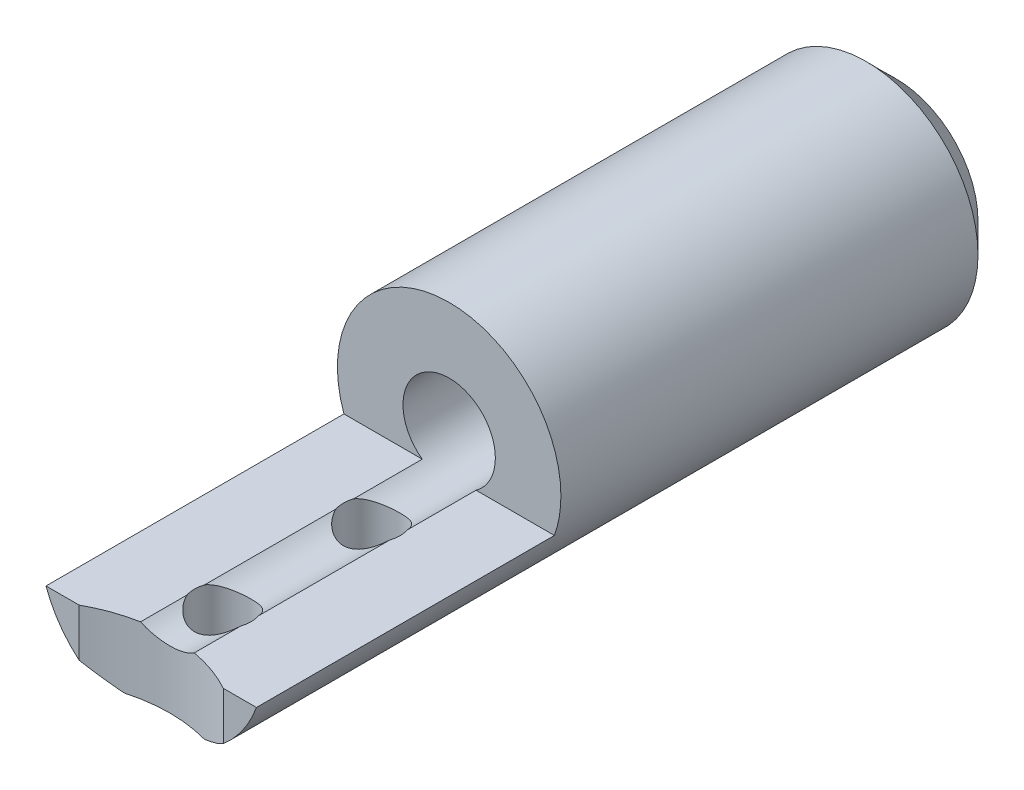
ISO-10303-21;
HEADER;
FILE_DESCRIPTION(('STEP AP214'),'2;1');
FILE_NAME('part.step','',(''),(''),'','','');
FILE_SCHEMA(('AUTOMOTIVE_DESIGN { 1 0 10303 214 1 1 1 1 }'));
ENDSEC;
DATA;
#1=APPLICATION_CONTEXT('core data for automotive mechanical design processes');
#2=APPLICATION_PROTOCOL_DEFINITION('international standard','automotive_design',2000,#1);
#3=PRODUCT_CONTEXT('',#1,'mechanical');
#4=PRODUCT('Part','Part','',(#3));
#5=PRODUCT_RELATED_PRODUCT_CATEGORY('part','',(#4));
#6=PRODUCT_DEFINITION_FORMATION('','',#4);
#7=PRODUCT_DEFINITION_CONTEXT('part definition',#1,'design');
#8=PRODUCT_DEFINITION('design','',#6,#7);
#9=PRODUCT_DEFINITION_SHAPE('','',#8);
#10=(LENGTH_UNIT() NAMED_UNIT(*) SI_UNIT(.MILLI.,.METRE.));
#11=(NAMED_UNIT(*) PLANE_ANGLE_UNIT() SI_UNIT($,.RADIAN.));
#12=(NAMED_UNIT(*) SI_UNIT($,.STERADIAN.) SOLID_ANGLE_UNIT());
#13=UNCERTAINTY_MEASURE_WITH_UNIT(LENGTH_MEASURE(1.E-05),#10,'distance_accuracy_value','');
#14=(GEOMETRIC_REPRESENTATION_CONTEXT(3) GLOBAL_UNCERTAINTY_ASSIGNED_CONTEXT((#13)) GLOBAL_UNIT_ASSIGNED_CONTEXT((#10,
#11,#12)) REPRESENTATION_CONTEXT('',''));
#15=CARTESIAN_POINT('',(0.,0.,0.));
#16=DIRECTION('',(0.,0.,1.));
#17=DIRECTION('',(1.,0.,0.));
#18=AXIS2_PLACEMENT_3D('',#15,#16,#17);
#19=CARTESIAN_POINT('',(0.,0.,0.));
#20=DIRECTION('',(0.,0.,1.));
#21=DIRECTION('',(1.,0.,0.));
#22=AXIS2_PLACEMENT_3D('',#19,#20,#21);
#23=PLANE('',#22);
#24=DIRECTION('',(0.,-1.,0.));
#25=VECTOR('',#24,1.);
#26=CARTESIAN_POINT('',(-6.14836106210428,9.525,0.));
#27=LINE('',#26,#25);
#28=CARTESIAN_POINT('',(-6.14836106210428,-3.20039999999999,0.));
#29=VERTEX_POINT('',#28);
#30=CARTESIAN_POINT('',(-6.14836106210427,-7.27483891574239,0.));
#31=VERTEX_POINT('',#30);
#32=EDGE_CURVE('E308',#29,#31,#27,.T.);
#33=ORIENTED_EDGE('',*,*,#32,.F.);
#34=DIRECTION('',(1.,0.,0.));
#35=VECTOR('',#34,1.);
#36=CARTESIAN_POINT('',(-9.52500000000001,-3.2004,0.));
#37=LINE('',#36,#35);
#38=CARTESIAN_POINT('',(-8.97123541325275,-3.2004,0.));
#39=VERTEX_POINT('',#38);
#40=EDGE_CURVE('E150',#39,#29,#37,.T.);
#41=ORIENTED_EDGE('',*,*,#40,.F.);
#42=CARTESIAN_POINT('',(0.,0.,0.));
#43=DIRECTION('',(0.,0.,1.));
#44=DIRECTION('',(1.,0.,0.));
#45=AXIS2_PLACEMENT_3D('',#42,#43,#44);
#46=CIRCLE('',#45,9.525);
#47=EDGE_CURVE('E165',#39,#31,#46,.T.);
#48=ORIENTED_EDGE('',*,*,#47,.T.);
#49=EDGE_LOOP('',(#33,#41,#48));
#50=FACE_BOUND('',#49,.T.);
#51=ADVANCED_FACE('F32',(#50),#23,.T.);
#52=CARTESIAN_POINT('',(0.,0.,-63.5));
#53=DIRECTION('',(0.,0.,1.));
#54=DIRECTION('',(1.,0.,0.));
#55=AXIS2_PLACEMENT_3D('',#52,#53,#54);
#56=CYLINDRICAL_SURFACE('',#55,3.937);
#57=DIRECTION('',(0.,0.,1.));
#58=VECTOR('',#57,1.);
#59=CARTESIAN_POINT('',(2.29290401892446,-3.2004,-63.5));
#60=LINE('',#59,#58);
#61=CARTESIAN_POINT('',(2.29290401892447,-3.2004,-6.84777134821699));
#62=VERTEX_POINT('',#61);
#63=CARTESIAN_POINT('',(2.29290401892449,-3.2004,-18.044228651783));
#64=VERTEX_POINT('',#63);
#65=EDGE_CURVE('E180',#62,#64,#60,.F.);
#66=ORIENTED_EDGE('',*,*,#65,.T.);
#67=CARTESIAN_POINT('',(0.,-3.93699999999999,-21.209));
#68=CARTESIAN_POINT('',(0.123002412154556,-3.93699156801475,-21.2089907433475));
#69=CARTESIAN_POINT('',(0.246180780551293,-3.93117348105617,-21.1995293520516));
#70=CARTESIAN_POINT('',(0.488792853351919,-3.90844960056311,-21.1621760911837));
#71=CARTESIAN_POINT('',(0.608217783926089,-3.89151959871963,-21.1342439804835));
#72=CARTESIAN_POINT('',(0.839316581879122,-3.848281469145,-21.0615501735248));
#73=CARTESIAN_POINT('',(0.951025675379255,-3.82201986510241,-21.0168719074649));
#74=CARTESIAN_POINT('',(1.16499213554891,-3.76232879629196,-20.9124941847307));
#75=CARTESIAN_POINT('',(1.26725116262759,-3.72890059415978,-20.8527973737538));
#76=CARTESIAN_POINT('',(1.46846868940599,-3.6545794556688,-20.7149035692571));
#77=CARTESIAN_POINT('',(1.56654273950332,-3.61330708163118,-20.6356244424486));
#78=CARTESIAN_POINT('',(1.74886365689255,-3.52867839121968,-20.4632768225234));
#79=CARTESIAN_POINT('',(1.83309204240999,-3.48531938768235,-20.3701902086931));
#80=CARTESIAN_POINT('',(1.99638589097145,-3.39473139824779,-20.1587538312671));
#81=CARTESIAN_POINT('',(2.07337913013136,-3.34772596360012,-20.0386939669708));
#82=CARTESIAN_POINT('',(2.20583759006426,-3.26197752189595,-19.784579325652));
#83=CARTESIAN_POINT('',(2.26133854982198,-3.223220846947,-19.6505482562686));
#84=CARTESIAN_POINT('',(2.33705912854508,-3.16855407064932,-19.4064960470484));
#85=CARTESIAN_POINT('',(2.36263528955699,-3.1493523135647,-19.2988782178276));
#86=CARTESIAN_POINT('',(2.39880829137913,-3.12189405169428,-19.0798435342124));
#87=CARTESIAN_POINT('',(2.4094250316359,-3.11362300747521,-18.9684319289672));
#88=CARTESIAN_POINT('',(2.41505422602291,-3.1092602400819,-18.744712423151));
#89=CARTESIAN_POINT('',(2.4100310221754,-3.11319634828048,-18.6324030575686));
#90=CARTESIAN_POINT('',(2.38463361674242,-3.13268765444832,-18.4105368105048));
#91=CARTESIAN_POINT('',(2.36424745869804,-3.14825190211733,-18.3009821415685));
#92=CARTESIAN_POINT('',(2.30974633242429,-3.18843959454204,-18.0893268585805));
#93=CARTESIAN_POINT('',(2.27588212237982,-3.2128969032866,-17.9871282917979));
#94=CARTESIAN_POINT('',(2.19571125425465,-3.26820861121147,-17.7896227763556));
#95=CARTESIAN_POINT('',(2.14940012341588,-3.29906530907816,-17.6943183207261));
#96=CARTESIAN_POINT('',(2.03599785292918,-3.37045042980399,-17.4949574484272));
#97=CARTESIAN_POINT('',(1.96666218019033,-3.41171833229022,-17.3924427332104));
#98=CARTESIAN_POINT('',(1.81346531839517,-3.49556131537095,-17.1994052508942));
#99=CARTESIAN_POINT('',(1.72958966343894,-3.53813766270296,-17.1088945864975));
#100=CARTESIAN_POINT('',(1.53460035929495,-3.62741670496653,-16.9284333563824));
#101=CARTESIAN_POINT('',(1.42128407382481,-3.67376126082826,-16.8406643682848));
#102=CARTESIAN_POINT('',(1.17864630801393,-3.75861642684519,-16.6855468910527));
#103=CARTESIAN_POINT('',(1.0493323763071,-3.79713070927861,-16.6181888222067));
#104=CARTESIAN_POINT('',(0.849993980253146,-3.84471355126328,-16.5366066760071));
#105=CARTESIAN_POINT('',(0.784775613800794,-3.85858351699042,-16.5131202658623));
#106=CARTESIAN_POINT('',(0.652036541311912,-3.88321516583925,-16.4717280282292));
#107=CARTESIAN_POINT('',(0.584517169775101,-3.89397861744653,-16.4538190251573));
#108=CARTESIAN_POINT('',(0.447787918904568,-3.91205893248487,-16.4238812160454));
#109=CARTESIAN_POINT('',(0.378579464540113,-3.91937860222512,-16.4118476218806));
#110=CARTESIAN_POINT('',(0.239116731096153,-3.93035562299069,-16.3938461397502));
#111=CARTESIAN_POINT('',(0.168862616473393,-3.93401354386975,-16.3878773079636));
#112=CARTESIAN_POINT('',(-0.0223329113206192,-3.93877989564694,-16.3800893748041));
#113=CARTESIAN_POINT('',(-0.143685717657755,-3.93620882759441,-16.3842668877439));
#114=CARTESIAN_POINT('',(-0.383586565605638,-3.9201172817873,-16.410623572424));
#115=CARTESIAN_POINT('',(-0.502134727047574,-3.90659727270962,-16.4328019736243));
#116=CARTESIAN_POINT('',(-0.72952179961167,-3.87047874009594,-16.4930098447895));
#117=CARTESIAN_POINT('',(-0.838549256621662,-3.84818109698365,-16.530515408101));
#118=CARTESIAN_POINT('',(-1.04868971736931,-3.79630744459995,-16.619795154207));
#119=CARTESIAN_POINT('',(-1.14980128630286,-3.76673011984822,-16.6715719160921));
#120=CARTESIAN_POINT('',(-1.35248943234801,-3.69909370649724,-16.7938130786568));
#121=CARTESIAN_POINT('',(-1.4530489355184,-3.66047569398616,-16.8656499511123));
#122=CARTESIAN_POINT('',(-1.64142215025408,-3.57997489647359,-17.0230373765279));
#123=CARTESIAN_POINT('',(-1.72922105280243,-3.5380884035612,-17.1086036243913));
#124=CARTESIAN_POINT('',(-1.90212250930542,-3.44856847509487,-17.3047318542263));
#125=CARTESIAN_POINT('',(-1.98517484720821,-3.40094096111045,-17.4171140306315));
#126=CARTESIAN_POINT('',(-2.13140876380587,-3.31125803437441,-17.6561530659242));
#127=CARTESIAN_POINT('',(-2.19460782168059,-3.26919773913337,-17.7827972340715));
#128=CARTESIAN_POINT('',(-2.28748237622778,-3.20466648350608,-18.0197682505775));
#129=CARTESIAN_POINT('',(-2.32143664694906,-3.1799298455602,-18.1277930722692));
#130=CARTESIAN_POINT('',(-2.37400776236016,-3.14088321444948,-18.3492728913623));
#131=CARTESIAN_POINT('',(-2.39264738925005,-3.1265577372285,-18.4627195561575));
#132=CARTESIAN_POINT('',(-2.41355397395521,-3.11045313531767,-18.6925830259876));
#133=CARTESIAN_POINT('',(-2.41574367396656,-3.10873321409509,-18.8090112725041));
#134=CARTESIAN_POINT('',(-2.40338336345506,-3.11829581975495,-19.0404583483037));
#135=CARTESIAN_POINT('',(-2.38882573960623,-3.12958426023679,-19.1554765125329));
#136=CARTESIAN_POINT('',(-2.34538142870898,-3.16224897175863,-19.3733315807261));
#137=CARTESIAN_POINT('',(-2.3174754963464,-3.18293048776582,-19.4764763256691));
#138=CARTESIAN_POINT('',(-2.24905790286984,-3.23163486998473,-19.6766286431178));
#139=CARTESIAN_POINT('',(-2.20854132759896,-3.25966059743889,-19.7736338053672));
#140=CARTESIAN_POINT('',(-2.10909698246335,-3.32501414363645,-19.9744092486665));
#141=CARTESIAN_POINT('',(-2.04831875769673,-3.36310675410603,-20.077010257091));
#142=CARTESIAN_POINT('',(-1.91293471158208,-3.441916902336,-20.2715722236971));
#143=CARTESIAN_POINT('',(-1.83831745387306,-3.48263659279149,-20.363524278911));
#144=CARTESIAN_POINT('',(-1.66157117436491,-3.57079695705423,-20.5513535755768));
#145=CARTESIAN_POINT('',(-1.55690690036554,-3.61811742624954,-20.6449190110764));
#146=CARTESIAN_POINT('',(-1.33116864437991,-3.70710581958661,-20.8135128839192));
#147=CARTESIAN_POINT('',(-1.21008676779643,-3.74877100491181,-20.8885323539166));
#148=CARTESIAN_POINT('',(-1.01918534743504,-3.80336154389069,-20.984337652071));
#149=CARTESIAN_POINT('',(-0.954483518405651,-3.82015106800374,-21.0133412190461));
#150=CARTESIAN_POINT('',(-0.822185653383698,-3.85078907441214,-21.0657204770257));
#151=CARTESIAN_POINT('',(-0.754591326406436,-3.86463926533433,-21.089099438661));
#152=CARTESIAN_POINT('',(-0.617229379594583,-3.88893951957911,-21.1298200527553));
#153=CARTESIAN_POINT('',(-0.547468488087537,-3.8993991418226,-21.1471786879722));
#154=CARTESIAN_POINT('',(-0.406274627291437,-3.91662606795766,-21.1756404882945));
#155=CARTESIAN_POINT('',(-0.334843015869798,-3.92339626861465,-21.1867485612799));
#156=CARTESIAN_POINT('',(-0.21935451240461,-3.93112748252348,-21.1994093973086));
#157=CARTESIAN_POINT('',(-0.175592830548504,-3.93332620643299,-21.2030023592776));
#158=CARTESIAN_POINT('',(-0.0878949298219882,-3.93626401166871,-21.2077993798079));
#159=CARTESIAN_POINT('',(-0.0439587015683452,-3.9370030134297,-21.20900330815));
#160=CARTESIAN_POINT('',(0.,-3.93699999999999,-21.209));
#161=B_SPLINE_CURVE_WITH_KNOTS('',3,(#67,#68,#69,#70,#71,#72,#73,#74,#75,#76,#77,#78,#79,#80,
#81,#82,#83,#84,#85,#86,#87,#88,#89,#90,#91,#92,#93,#94,#95,#96,#97,#98,#99,#100,#101,#102,#103,
#104,#105,#106,#107,#108,#109,#110,#111,#112,#113,#114,#115,#116,#117,#118,#119,#120,#121,#122,
#123,#124,#125,#126,#127,#128,#129,#130,#131,#132,#133,#134,#135,#136,#137,#138,#139,#140,#141,
#142,#143,#144,#145,#146,#147,#148,#149,#150,#151,#152,#153,#154,#155,#156,#157,#158,#159,#160),
.UNSPECIFIED.,.T.,.F.,(4,2,2,2,2,2,2,2,2,2,2,2,2,2,2,2,2,2,2,2,2,2,2,2,2,2,2,2,2,2,2,2,2,2,2,2,
2,2,2,2,2,2,2,2,2,2,4),(0.,0.368829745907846,0.738465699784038,1.10628407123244,
1.47403769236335,1.87056889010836,2.26762517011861,2.71596903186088,3.16356411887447,
3.49896078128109,3.83391086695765,4.16962517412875,4.50560102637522,4.83559822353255,
5.16571416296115,5.55562641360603,5.9459288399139,6.3956306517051,6.84512107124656,
7.05693032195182,7.26861875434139,7.4801343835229,7.69161709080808,8.05394521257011,
8.41625782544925,8.76710316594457,9.11801195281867,9.50493101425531,9.89229558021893,
10.3332038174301,10.7737227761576,11.1200388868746,11.4658388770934,11.813261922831,
12.1608429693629,12.4860915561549,12.8114670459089,13.1856696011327,13.5601827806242,
14.0026080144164,14.4452467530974,14.6635683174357,14.881762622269,15.0993363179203,
15.3167389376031,15.4485444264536,15.5803570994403),.UNSPECIFIED.);
#162=CARTESIAN_POINT('',(-2.29290401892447,-3.2004,-18.044228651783));
#163=VERTEX_POINT('',#162);
#164=EDGE_CURVE('E252',#64,#163,#161,.T.);
#165=ORIENTED_EDGE('',*,*,#164,.T.);
#166=DIRECTION('',(0.,0.,1.));
#167=VECTOR('',#166,1.);
#168=CARTESIAN_POINT('',(-2.29290401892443,-3.2004,-63.5));
#169=LINE('',#168,#167);
#170=CARTESIAN_POINT('',(-2.29290401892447,-3.2004,-6.847771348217));
#171=VERTEX_POINT('',#170);
#172=EDGE_CURVE('E176',#163,#171,#169,.T.);
#173=ORIENTED_EDGE('',*,*,#172,.T.);
#174=CARTESIAN_POINT('',(0.,-3.937,-8.509));
#175=CARTESIAN_POINT('',(0.123002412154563,-3.93699156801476,-8.5089907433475));
#176=CARTESIAN_POINT('',(0.246180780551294,-3.93117348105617,-8.49952935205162));
#177=CARTESIAN_POINT('',(0.488792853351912,-3.9084496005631,-8.46217609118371));
#178=CARTESIAN_POINT('',(0.608217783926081,-3.89151959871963,-8.43424398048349));
#179=CARTESIAN_POINT('',(0.839316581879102,-3.848281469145,-8.36155017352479));
#180=CARTESIAN_POINT('',(0.951025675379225,-3.82201986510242,-8.31687190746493));
#181=CARTESIAN_POINT('',(1.16499213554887,-3.76232879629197,-8.21249418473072));
#182=CARTESIAN_POINT('',(1.26725116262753,-3.72890059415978,-8.15279737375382));
#183=CARTESIAN_POINT('',(1.46846868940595,-3.65457945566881,-8.01490356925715));
#184=CARTESIAN_POINT('',(1.56654273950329,-3.61330708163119,-7.93562444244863));
#185=CARTESIAN_POINT('',(1.74886365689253,-3.52867839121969,-7.7632768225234));
#186=CARTESIAN_POINT('',(1.83309204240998,-3.48531938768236,-7.67019020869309));
#187=CARTESIAN_POINT('',(1.99638589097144,-3.39473139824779,-7.45875383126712));
#188=CARTESIAN_POINT('',(2.07337913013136,-3.34772596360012,-7.33869396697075));
#189=CARTESIAN_POINT('',(2.20583759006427,-3.26197752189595,-7.08457932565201));
#190=CARTESIAN_POINT('',(2.261338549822,-3.22322084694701,-6.95054825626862));
#191=CARTESIAN_POINT('',(2.33705912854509,-3.16855407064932,-6.70649604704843));
#192=CARTESIAN_POINT('',(2.36263528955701,-3.14935231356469,-6.59887821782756));
#193=CARTESIAN_POINT('',(2.39880829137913,-3.12189405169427,-6.37984353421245));
#194=CARTESIAN_POINT('',(2.40942503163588,-3.11362300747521,-6.26843192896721));
#195=CARTESIAN_POINT('',(2.4150542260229,-3.1092602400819,-6.04471242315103));
#196=CARTESIAN_POINT('',(2.41003102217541,-3.11319634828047,-5.93240305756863));
#197=CARTESIAN_POINT('',(2.38463361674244,-3.13268765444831,-5.71053681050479));
#198=CARTESIAN_POINT('',(2.36424745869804,-3.14825190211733,-5.60098214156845));
#199=CARTESIAN_POINT('',(2.30974633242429,-3.18843959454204,-5.38932685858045));
#200=CARTESIAN_POINT('',(2.27588212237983,-3.21289690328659,-5.28712829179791));
#201=CARTESIAN_POINT('',(2.19571125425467,-3.26820861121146,-5.08962277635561));
#202=CARTESIAN_POINT('',(2.14940012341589,-3.29906530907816,-4.99431832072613));
#203=CARTESIAN_POINT('',(2.03599785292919,-3.37045042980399,-4.79495744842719));
#204=CARTESIAN_POINT('',(1.96666218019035,-3.41171833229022,-4.69244273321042));
#205=CARTESIAN_POINT('',(1.81346531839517,-3.49556131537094,-4.4994052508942));
#206=CARTESIAN_POINT('',(1.72958966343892,-3.53813766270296,-4.40889458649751));
#207=CARTESIAN_POINT('',(1.53460035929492,-3.62741670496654,-4.22843335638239));
#208=CARTESIAN_POINT('',(1.42128407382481,-3.67376126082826,-4.14066436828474));
#209=CARTESIAN_POINT('',(1.17864630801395,-3.75861642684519,-3.98554689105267));
#210=CARTESIAN_POINT('',(1.04933237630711,-3.79713070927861,-3.91818882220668));
#211=CARTESIAN_POINT('',(0.84999398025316,-3.84471355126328,-3.83660667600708));
#212=CARTESIAN_POINT('',(0.784775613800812,-3.85858351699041,-3.81312026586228));
#213=CARTESIAN_POINT('',(0.652036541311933,-3.88321516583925,-3.77172802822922));
#214=CARTESIAN_POINT('',(0.58451716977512,-3.89397861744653,-3.75381902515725));
#215=CARTESIAN_POINT('',(0.447787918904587,-3.91205893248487,-3.72388121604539));
#216=CARTESIAN_POINT('',(0.378579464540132,-3.91937860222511,-3.71184762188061));
#217=CARTESIAN_POINT('',(0.23911673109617,-3.93035562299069,-3.69384613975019));
#218=CARTESIAN_POINT('',(0.168862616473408,-3.93401354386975,-3.68787730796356));
#219=CARTESIAN_POINT('',(-0.0223329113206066,-3.93877989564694,-3.68008937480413));
#220=CARTESIAN_POINT('',(-0.143685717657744,-3.93620882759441,-3.68426688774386));
#221=CARTESIAN_POINT('',(-0.383586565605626,-3.9201172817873,-3.71062357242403));
#222=CARTESIAN_POINT('',(-0.502134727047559,-3.90659727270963,-3.73280197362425));
#223=CARTESIAN_POINT('',(-0.729521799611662,-3.87047874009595,-3.79300984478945));
#224=CARTESIAN_POINT('',(-0.838549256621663,-3.84818109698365,-3.83051540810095));
#225=CARTESIAN_POINT('',(-1.04868971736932,-3.79630744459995,-3.91979515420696));
#226=CARTESIAN_POINT('',(-1.14980128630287,-3.76673011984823,-3.97157191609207));
#227=CARTESIAN_POINT('',(-1.35248943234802,-3.69909370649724,-4.09381307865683));
#228=CARTESIAN_POINT('',(-1.45304893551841,-3.66047569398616,-4.16564995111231));
#229=CARTESIAN_POINT('',(-1.6414221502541,-3.57997489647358,-4.32303737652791));
#230=CARTESIAN_POINT('',(-1.72922105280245,-3.53808840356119,-4.40860362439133));
#231=CARTESIAN_POINT('',(-1.90212250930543,-3.44856847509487,-4.60473185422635));
#232=CARTESIAN_POINT('',(-1.98517484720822,-3.40094096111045,-4.71711403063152));
#233=CARTESIAN_POINT('',(-2.13140876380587,-3.31125803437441,-4.95615306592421));
#234=CARTESIAN_POINT('',(-2.19460782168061,-3.26919773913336,-5.08279723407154));
#235=CARTESIAN_POINT('',(-2.28748237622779,-3.20466648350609,-5.31976825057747));
#236=CARTESIAN_POINT('',(-2.32143664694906,-3.17992984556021,-5.42779307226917));
#237=CARTESIAN_POINT('',(-2.37400776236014,-3.14088321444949,-5.64927289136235));
#238=CARTESIAN_POINT('',(-2.39264738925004,-3.1265577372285,-5.7627195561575));
#239=CARTESIAN_POINT('',(-2.4135539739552,-3.11045313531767,-5.99258302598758));
#240=CARTESIAN_POINT('',(-2.41574367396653,-3.1087332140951,-6.10901127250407));
#241=CARTESIAN_POINT('',(-2.40338336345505,-3.11829581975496,-6.34045834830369));
#242=CARTESIAN_POINT('',(-2.38882573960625,-3.12958426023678,-6.45547651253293));
#243=CARTESIAN_POINT('',(-2.34538142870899,-3.16224897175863,-6.67333158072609));
#244=CARTESIAN_POINT('',(-2.31747549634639,-3.18293048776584,-6.77647632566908));
#245=CARTESIAN_POINT('',(-2.24905790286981,-3.23163486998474,-6.97662864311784));
#246=CARTESIAN_POINT('',(-2.20854132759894,-3.25966059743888,-7.07363380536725));
#247=CARTESIAN_POINT('',(-2.10909698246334,-3.32501414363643,-7.27440924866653));
#248=CARTESIAN_POINT('',(-2.04831875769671,-3.36310675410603,-7.37701025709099));
#249=CARTESIAN_POINT('',(-1.91293471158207,-3.44191690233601,-7.5715722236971));
#250=CARTESIAN_POINT('',(-1.83831745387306,-3.48263659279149,-7.66352427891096));
#251=CARTESIAN_POINT('',(-1.6615711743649,-3.57079695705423,-7.85135357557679));
#252=CARTESIAN_POINT('',(-1.55690690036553,-3.61811742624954,-7.94491901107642));
#253=CARTESIAN_POINT('',(-1.3311686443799,-3.70710581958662,-8.11351288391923));
#254=CARTESIAN_POINT('',(-1.21008676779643,-3.7487710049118,-8.18853235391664));
#255=CARTESIAN_POINT('',(-1.01918534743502,-3.80336154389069,-8.28433765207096));
#256=CARTESIAN_POINT('',(-0.95448351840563,-3.82015106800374,-8.31334121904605));
#257=CARTESIAN_POINT('',(-0.822185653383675,-3.85078907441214,-8.36572047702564));
#258=CARTESIAN_POINT('',(-0.754591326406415,-3.86463926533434,-8.38909943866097));
#259=CARTESIAN_POINT('',(-0.617229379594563,-3.88893951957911,-8.42982005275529));
#260=CARTESIAN_POINT('',(-0.547468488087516,-3.8993991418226,-8.44717868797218));
#261=CARTESIAN_POINT('',(-0.406274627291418,-3.91662606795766,-8.47564048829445));
#262=CARTESIAN_POINT('',(-0.334843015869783,-3.92339626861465,-8.4867485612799));
#263=CARTESIAN_POINT('',(-0.219354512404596,-3.93112748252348,-8.49940939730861));
#264=CARTESIAN_POINT('',(-0.175592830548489,-3.93332620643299,-8.50300235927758));
#265=CARTESIAN_POINT('',(-0.087894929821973,-3.93626401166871,-8.50779937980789));
#266=CARTESIAN_POINT('',(-0.0439587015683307,-3.93700301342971,-8.50900330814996));
#267=CARTESIAN_POINT('',(0.,-3.937,-8.509));
#268=B_SPLINE_CURVE_WITH_KNOTS('',3,(#174,#175,#176,#177,#178,#179,#180,#181,#182,#183,#184,
#185,#186,#187,#188,#189,#190,#191,#192,#193,#194,#195,#196,#197,#198,#199,#200,#201,#202,#203,
#204,#205,#206,#207,#208,#209,#210,#211,#212,#213,#214,#215,#216,#217,#218,#219,#220,#221,#222,
#223,#224,#225,#226,#227,#228,#229,#230,#231,#232,#233,#234,#235,#236,#237,#238,#239,#240,#241,
#242,#243,#244,#245,#246,#247,#248,#249,#250,#251,#252,#253,#254,#255,#256,#257,#258,#259,#260,
#261,#262,#263,#264,#265,#266,#267),.UNSPECIFIED.,.T.,.F.,(4,2,2,2,2,2,2,2,2,2,2,2,2,2,2,2,2,2,
2,2,2,2,2,2,2,2,2,2,2,2,2,2,2,2,2,2,2,2,2,2,2,2,2,2,2,2,4),(0.,0.368829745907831,
0.738465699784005,1.10628407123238,1.47403769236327,1.87056889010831,2.26762517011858,
2.71596903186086,3.16356411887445,3.49896078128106,3.83391086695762,4.16962517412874,
4.50560102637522,4.83559822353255,5.16571416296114,5.55562641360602,5.94592883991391,
6.39563065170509,6.84512107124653,7.0569303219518,7.26861875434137,7.48013438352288,
7.69161709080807,8.05394521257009,8.41625782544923,8.76710316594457,9.11801195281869,
9.50493101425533,9.89229558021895,10.3332038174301,10.7737227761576,11.1200388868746,
11.4658388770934,11.813261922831,12.1608429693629,12.4860915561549,12.8114670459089,
13.1856696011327,13.5601827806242,14.0026080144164,14.4452467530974,14.6635683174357,
14.881762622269,15.0993363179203,15.3167389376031,15.4485444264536,15.5803570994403),.UNSPECIFIED.);
#269=EDGE_CURVE('E224',#171,#62,#268,.T.);
#270=ORIENTED_EDGE('',*,*,#269,.T.);
#271=EDGE_LOOP('',(#66,#165,#173,#270));
#272=FACE_BOUND('',#271,.T.);
#273=ADVANCED_FACE('F251',(#272),#56,.F.);
#274=CARTESIAN_POINT('',(-2.29290401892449,-3.2004,-5.34422865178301));
#275=VERTEX_POINT('',#274);
#276=CARTESIAN_POINT('',(-2.29290401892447,-3.2004,-1.37880061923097));
#277=VERTEX_POINT('',#276);
#278=EDGE_CURVE('E171',#275,#277,#169,.T.);
#279=ORIENTED_EDGE('',*,*,#278,.T.);
#280=CARTESIAN_POINT('',(-2.29290401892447,-3.2004,-1.37880061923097));
#281=CARTESIAN_POINT('',(-2.20528694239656,-3.26318358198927,-1.39489074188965));
#282=CARTESIAN_POINT('',(-2.11501801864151,-3.32239996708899,-1.41050084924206));
#283=CARTESIAN_POINT('',(-1.92974586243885,-3.43332065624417,-1.44038169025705));
#284=CARTESIAN_POINT('',(-1.83474181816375,-3.48502366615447,-1.45465219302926));
#285=CARTESIAN_POINT('',(-1.64050987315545,-3.58056206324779,-1.48148104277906));
#286=CARTESIAN_POINT('',(-1.54127815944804,-3.6243901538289,-1.49403779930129));
#287=CARTESIAN_POINT('',(-1.33933265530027,-3.70377178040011,-1.51708871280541));
#288=CARTESIAN_POINT('',(-1.23661912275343,-3.73932592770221,-1.52758302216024));
#289=CARTESIAN_POINT('',(-1.02825362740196,-3.80190921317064,-1.54623812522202));
#290=CARTESIAN_POINT('',(-0.922597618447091,-3.82892591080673,-1.55439551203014));
#291=CARTESIAN_POINT('',(-0.709205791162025,-3.87413151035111,-1.56813331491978));
#292=CARTESIAN_POINT('',(-0.601469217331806,-3.89231714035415,-1.57371277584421));
#293=CARTESIAN_POINT('',(-0.384905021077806,-3.91965712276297,-1.58212775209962));
#294=CARTESIAN_POINT('',(-0.276079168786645,-3.9288242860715,-1.58496715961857));
#295=CARTESIAN_POINT('',(-0.0579654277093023,-3.93808681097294,-1.58783617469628));
#296=CARTESIAN_POINT('',(0.0513226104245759,-3.93817897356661,-1.58786479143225));
#297=CARTESIAN_POINT('',(0.266641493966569,-3.92939898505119,-1.58514510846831));
#298=CARTESIAN_POINT('',(0.372682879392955,-3.92076082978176,-1.58246929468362));
#299=CARTESIAN_POINT('',(0.583661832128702,-3.89494648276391,-1.57452047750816));
#300=CARTESIAN_POINT('',(0.68859896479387,-3.87776704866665,-1.56924648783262));
#301=CARTESIAN_POINT('',(0.896626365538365,-3.8350104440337,-1.55623793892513));
#302=CARTESIAN_POINT('',(0.999716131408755,-3.80943102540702,-1.54850272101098));
#303=CARTESIAN_POINT('',(1.20332380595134,-3.75009879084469,-1.53077784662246));
#304=CARTESIAN_POINT('',(1.30384095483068,-3.71634359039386,-1.52078753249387));
#305=CARTESIAN_POINT('',(1.56118300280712,-3.61819994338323,-1.49218312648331));
#306=CARTESIAN_POINT('',(1.71553249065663,-3.54759478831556,-1.47199515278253));
#307=CARTESIAN_POINT('',(1.93868136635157,-3.42762654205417,-1.43888213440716));
#308=CARTESIAN_POINT('',(2.01161041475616,-3.38533530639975,-1.4273835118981));
#309=CARTESIAN_POINT('',(2.15452096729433,-3.296223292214,-1.40362074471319));
#310=CARTESIAN_POINT('',(2.22450236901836,-3.24940235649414,-1.3913565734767));
#311=CARTESIAN_POINT('',(2.29290401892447,-3.2004,-1.37880061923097));
#312=B_SPLINE_CURVE_WITH_KNOTS('',3,(#280,#281,#282,#283,#284,#285,#286,#287,#288,#289,#290,
#291,#292,#293,#294,#295,#296,#297,#298,#299,#300,#301,#302,#303,#304,#305,#306,#307,#308,#309,
#310,#311),.UNSPECIFIED.,.F.,.F.,(4,2,2,2,2,2,2,2,2,2,2,2,2,2,2,4),(0.,0.326869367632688,
0.653794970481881,0.981021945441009,1.30822473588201,1.63590214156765,1.96370085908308,
2.2910332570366,2.6184810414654,2.9373791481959,3.25639840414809,3.57550310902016,
3.89470099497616,4.40578367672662,4.66089484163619,4.9160148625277),.UNSPECIFIED.);
#313=CARTESIAN_POINT('',(2.29290401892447,-3.2004,-1.37880061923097));
#314=VERTEX_POINT('',#313);
#315=EDGE_CURVE('E282',#277,#314,#312,.T.);
#316=ORIENTED_EDGE('',*,*,#315,.T.);
#317=CARTESIAN_POINT('',(2.29290401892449,-3.2004,-5.34422865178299));
#318=VERTEX_POINT('',#317);
#319=EDGE_CURVE('E177',#314,#318,#60,.F.);
#320=ORIENTED_EDGE('',*,*,#319,.T.);
#321=EDGE_CURVE('E228',#318,#275,#268,.T.);
#322=ORIENTED_EDGE('',*,*,#321,.T.);
#323=EDGE_LOOP('',(#279,#316,#320,#322));
#324=FACE_BOUND('',#323,.T.);
#325=ADVANCED_FACE('F238',(#324),#56,.F.);
#326=CARTESIAN_POINT('',(0.,0.,-63.5));
#327=DIRECTION('',(0.,0.,1.));
#328=DIRECTION('',(1.,0.,0.));
#329=AXIS2_PLACEMENT_3D('',#326,#327,#328);
#330=CYLINDRICAL_SURFACE('',#329,9.525);
#331=CARTESIAN_POINT('',(-6.14836106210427,-7.27483891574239,0.));
#332=CARTESIAN_POINT('',(-5.94956066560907,-7.442843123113,-0.110015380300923));
#333=CARTESIAN_POINT('',(-5.74293423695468,-7.60351399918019,-0.21734534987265));
#334=CARTESIAN_POINT('',(-5.31623012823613,-7.90768796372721,-0.423675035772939));
#335=CARTESIAN_POINT('',(-5.09626462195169,-8.05131047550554,-0.522731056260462));
#336=CARTESIAN_POINT('',(-4.64204148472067,-8.32146858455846,-0.711284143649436));
#337=CARTESIAN_POINT('',(-4.40778077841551,-8.44800048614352,-0.800779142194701));
#338=CARTESIAN_POINT('',(-3.92430626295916,-8.68322338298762,-0.968727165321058));
#339=CARTESIAN_POINT('',(-3.67499306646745,-8.79177273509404,-1.04709188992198));
#340=CARTESIAN_POINT('',(-3.4195796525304,-8.89,-1.11846378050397));
#341=B_SPLINE_CURVE_WITH_KNOTS('',3,(#331,#332,#333,#334,#335,#336,#337,#338,#339,#340),
.UNSPECIFIED.,.F.,.F.,(4,2,2,2,4),(0.,0.84766488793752,1.68898936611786,2.53049548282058,
3.37834353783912),.UNSPECIFIED.);
#342=CARTESIAN_POINT('',(-3.4195796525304,-8.89,-1.11846378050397));
#343=VERTEX_POINT('',#342);
#344=EDGE_CURVE('E48',#31,#343,#341,.T.);
#345=ORIENTED_EDGE('',*,*,#344,.F.);
#346=ORIENTED_EDGE('',*,*,#47,.F.);
#347=DIRECTION('',(0.,0.,1.));
#348=VECTOR('',#347,1.);
#349=CARTESIAN_POINT('',(-8.97123541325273,-3.2004,-63.5));
#350=LINE('',#349,#348);
#351=CARTESIAN_POINT('',(-8.97123541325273,-3.2004,-25.4));
#352=VERTEX_POINT('',#351);
#353=EDGE_CURVE('E157',#352,#39,#350,.T.);
#354=ORIENTED_EDGE('',*,*,#353,.F.);
#355=CARTESIAN_POINT('',(0.,0.,-25.4));
#356=DIRECTION('',(0.,0.,1.));
#357=DIRECTION('',(1.,0.,0.));
#358=AXIS2_PLACEMENT_3D('',#355,#356,#357);
#359=CIRCLE('',#358,9.525);
#360=CARTESIAN_POINT('',(8.97123541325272,-3.2004,-25.4));
#361=VERTEX_POINT('',#360);
#362=EDGE_CURVE('E155',#352,#361,#359,.F.);
#363=ORIENTED_EDGE('',*,*,#362,.T.);
#364=DIRECTION('',(0.,0.,1.));
#365=VECTOR('',#364,1.);
#366=CARTESIAN_POINT('',(8.97123541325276,-3.2004,-63.5));
#367=LINE('',#366,#365);
#368=CARTESIAN_POINT('',(8.97123541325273,-3.2004,0.));
#369=VERTEX_POINT('',#368);
#370=EDGE_CURVE('E159',#369,#361,#367,.F.);
#371=ORIENTED_EDGE('',*,*,#370,.F.);
#372=CARTESIAN_POINT('',(6.14836106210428,-7.27483891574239,0.));
#373=VERTEX_POINT('',#372);
#374=EDGE_CURVE('E132',#373,#369,#46,.T.);
#375=ORIENTED_EDGE('',*,*,#374,.F.);
#376=CARTESIAN_POINT('',(3.41957965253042,-8.89,-1.11846378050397));
#377=CARTESIAN_POINT('',(3.67499306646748,-8.79177273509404,-1.04709188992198));
#378=CARTESIAN_POINT('',(3.92430626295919,-8.68322338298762,-0.96872716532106));
#379=CARTESIAN_POINT('',(4.40778077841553,-8.44800048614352,-0.800779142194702));
#380=CARTESIAN_POINT('',(4.64204148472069,-8.32146858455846,-0.711284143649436));
#381=CARTESIAN_POINT('',(5.09626462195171,-8.05131047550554,-0.522731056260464));
#382=CARTESIAN_POINT('',(5.31623012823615,-7.90768796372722,-0.423675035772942));
#383=CARTESIAN_POINT('',(5.7429342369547,-7.60351399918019,-0.217345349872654));
#384=CARTESIAN_POINT('',(5.94956066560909,-7.442843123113,-0.110015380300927));
#385=CARTESIAN_POINT('',(6.14836106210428,-7.27483891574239,0.));
#386=B_SPLINE_CURVE_WITH_KNOTS('',3,(#376,#377,#378,#379,#380,#381,#382,#383,#384,#385),
.UNSPECIFIED.,.F.,.F.,(4,2,2,2,4),(0.,0.847848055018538,1.68935417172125,2.53067864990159,
3.37834353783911),.UNSPECIFIED.);
#387=CARTESIAN_POINT('',(3.41957965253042,-8.89,-1.11846378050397));
#388=VERTEX_POINT('',#387);
#389=EDGE_CURVE('E120',#388,#373,#386,.T.);
#390=ORIENTED_EDGE('',*,*,#389,.F.);
#391=DIRECTION('',(0.,0.,1.));
#392=VECTOR('',#391,1.);
#393=CARTESIAN_POINT('',(3.41957965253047,-8.89,-63.5));
#394=LINE('',#393,#392);
#395=CARTESIAN_POINT('',(3.41957965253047,-8.89,-25.4));
#396=VERTEX_POINT('',#395);
#397=EDGE_CURVE('E130',#396,#388,#394,.T.);
#398=ORIENTED_EDGE('',*,*,#397,.F.);
#399=CARTESIAN_POINT('',(0.,0.,-25.4));
#400=DIRECTION('',(0.,0.,1.));
#401=DIRECTION('',(1.,0.,0.));
#402=AXIS2_PLACEMENT_3D('',#399,#400,#401);
#403=CIRCLE('',#402,9.525);
#404=CARTESIAN_POINT('',(-3.4195796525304,-8.89,-25.4));
#405=VERTEX_POINT('',#404);
#406=EDGE_CURVE('E179',#396,#405,#403,.F.);
#407=ORIENTED_EDGE('',*,*,#406,.T.);
#408=DIRECTION('',(0.,0.,1.));
#409=VECTOR('',#408,1.);
#410=CARTESIAN_POINT('',(-3.4195796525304,-8.89,-63.5));
#411=LINE('',#410,#409);
#412=EDGE_CURVE('E140',#343,#405,#411,.F.);
#413=ORIENTED_EDGE('',*,*,#412,.F.);
#414=EDGE_LOOP('',(#345,#346,#354,#363,#371,#375,#390,#398,#407,#413));
#415=FACE_BOUND('',#414,.T.);
#416=CARTESIAN_POINT('',(0.,0.,-60.96));
#417=DIRECTION('',(0.,0.,1.));
#418=DIRECTION('',(1.,0.,0.));
#419=AXIS2_PLACEMENT_3D('',#416,#417,#418);
#420=CIRCLE('',#419,9.525);
#421=CARTESIAN_POINT('',(9.52499999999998,0.,-60.96));
#422=VERTEX_POINT('',#421);
#423=EDGE_CURVE('E182',#422,#422,#420,.T.);
#424=ORIENTED_EDGE('',*,*,#423,.T.);
#425=EDGE_LOOP('',(#424));
#426=FACE_BOUND('',#425,.T.);
#427=CARTESIAN_POINT('',(0.,-9.525,-53.5878128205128));
#428=CARTESIAN_POINT('',(0.105182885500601,-9.52499806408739,-53.5878089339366));
#429=CARTESIAN_POINT('',(0.210415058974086,-9.52323983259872,-53.5790133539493));
#430=CARTESIAN_POINT('',(0.417905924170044,-9.51639547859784,-53.5440907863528));
#431=CARTESIAN_POINT('',(0.520162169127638,-9.5113066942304,-53.5179499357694));
#432=CARTESIAN_POINT('',(0.718671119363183,-9.49836958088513,-53.4491754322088));
#433=CARTESIAN_POINT('',(0.814929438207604,-9.49052387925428,-53.4065574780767));
#434=CARTESIAN_POINT('',(0.9989225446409,-9.47292625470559,-53.3060849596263));
#435=CARTESIAN_POINT('',(1.08665785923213,-9.46317444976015,-53.2482313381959));
#436=CARTESIAN_POINT('',(1.25229453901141,-9.44269244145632,-53.1181094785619));
#437=CARTESIAN_POINT('',(1.33006551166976,-9.43195191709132,-53.0456768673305));
#438=CARTESIAN_POINT('',(1.47243693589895,-9.41077824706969,-52.8888064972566));
#439=CARTESIAN_POINT('',(1.53703636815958,-9.40034512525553,-52.8043678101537));
#440=CARTESIAN_POINT('',(1.65178458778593,-9.38086680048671,-52.6249460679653));
#441=CARTESIAN_POINT('',(1.70179862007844,-9.37183488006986,-52.5298752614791));
#442=CARTESIAN_POINT('',(1.78509310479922,-9.35632803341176,-52.3324706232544));
#443=CARTESIAN_POINT('',(1.81837518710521,-9.34985285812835,-52.2301375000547));
#444=CARTESIAN_POINT('',(1.86683823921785,-9.34029700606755,-52.0225151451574));
#445=CARTESIAN_POINT('',(1.88224783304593,-9.33717349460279,-51.9172812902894));
#446=CARTESIAN_POINT('',(1.89523855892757,-9.33454567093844,-51.7056790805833));
#447=CARTESIAN_POINT('',(1.89282148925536,-9.33504099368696,-51.5993108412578));
#448=CARTESIAN_POINT('',(1.87041240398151,-9.33955594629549,-51.3901301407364));
#449=CARTESIAN_POINT('',(1.85068224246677,-9.34352306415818,-51.2872883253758));
#450=CARTESIAN_POINT('',(1.79462026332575,-9.35445195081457,-51.0864041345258));
#451=CARTESIAN_POINT('',(1.75828766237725,-9.36141386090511,-50.9883619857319));
#452=CARTESIAN_POINT('',(1.66980145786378,-9.37760171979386,-50.7991042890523));
#453=CARTESIAN_POINT('',(1.6175438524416,-9.38684247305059,-50.7079386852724));
#454=CARTESIAN_POINT('',(1.49876444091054,-9.40653728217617,-50.5355721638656));
#455=CARTESIAN_POINT('',(1.4322410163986,-9.41699147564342,-50.4543723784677));
#456=CARTESIAN_POINT('',(1.28541524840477,-9.43816287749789,-50.3027312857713));
#457=CARTESIAN_POINT('',(1.20488936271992,-9.44888146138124,-50.2325064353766));
#458=CARTESIAN_POINT('',(1.03308792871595,-9.4692040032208,-50.106527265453));
#459=CARTESIAN_POINT('',(0.94181224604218,-9.47880794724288,-50.0507731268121));
#460=CARTESIAN_POINT('',(0.750863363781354,-9.49584222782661,-49.9552788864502));
#461=CARTESIAN_POINT('',(0.651177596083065,-9.50326923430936,-49.9155632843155));
#462=CARTESIAN_POINT('',(0.446368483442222,-9.51508749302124,-49.8535029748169));
#463=CARTESIAN_POINT('',(0.341245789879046,-9.51947910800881,-49.8311561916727));
#464=CARTESIAN_POINT('',(0.13040720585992,-9.52468132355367,-49.8047737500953));
#465=CARTESIAN_POINT('',(0.0247297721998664,-9.52554985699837,-49.8004418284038));
#466=CARTESIAN_POINT('',(-0.18583897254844,-9.52376886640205,-49.8094145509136));
#467=CARTESIAN_POINT('',(-0.290730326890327,-9.52111953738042,-49.8227182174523));
#468=CARTESIAN_POINT('',(-0.495795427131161,-9.51263673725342,-49.8663383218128));
#469=CARTESIAN_POINT('',(-0.596002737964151,-9.50683168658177,-49.8965029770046));
#470=CARTESIAN_POINT('',(-0.789937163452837,-9.49268595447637,-49.9728231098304));
#471=CARTESIAN_POINT('',(-0.883663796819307,-9.48434508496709,-50.0189797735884));
#472=CARTESIAN_POINT('',(-1.06322739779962,-9.4659086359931,-50.1266162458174));
#473=CARTESIAN_POINT('',(-1.14895517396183,-9.45579304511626,-50.1882747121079));
#474=CARTESIAN_POINT('',(-1.30895354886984,-9.43497678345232,-50.3249250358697));
#475=CARTESIAN_POINT('',(-1.38322293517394,-9.42427605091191,-50.3999183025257));
#476=CARTESIAN_POINT('',(-1.51933778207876,-9.40330060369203,-50.5624573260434));
#477=CARTESIAN_POINT('',(-1.58097998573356,-9.39303469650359,-50.6501746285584));
#478=CARTESIAN_POINT('',(-1.68865599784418,-9.37427679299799,-50.8348925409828));
#479=CARTESIAN_POINT('',(-1.73469042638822,-9.36578472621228,-50.9318927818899));
#480=CARTESIAN_POINT('',(-1.80956546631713,-9.35160692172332,-51.1319374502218));
#481=CARTESIAN_POINT('',(-1.83849459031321,-9.34590676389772,-51.2349476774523));
#482=CARTESIAN_POINT('',(-1.87860679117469,-9.33792735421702,-51.444492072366));
#483=CARTESIAN_POINT('',(-1.88979214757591,-9.33564766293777,-51.5510257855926));
#484=CARTESIAN_POINT('',(-1.89401581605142,-9.33479146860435,-51.762552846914));
#485=CARTESIAN_POINT('',(-1.88737524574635,-9.33614943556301,-51.8675396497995));
#486=CARTESIAN_POINT('',(-1.85684365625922,-9.34226925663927,-52.0748678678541));
#487=CARTESIAN_POINT('',(-1.83295277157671,-9.3470310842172,-52.1772093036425));
#488=CARTESIAN_POINT('',(-1.76874113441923,-9.35939297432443,-52.3761408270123));
#489=CARTESIAN_POINT('',(-1.72845925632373,-9.36698631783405,-52.4727439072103));
#490=CARTESIAN_POINT('',(-1.63264574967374,-9.3841595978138,-52.6578708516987));
#491=CARTESIAN_POINT('',(-1.57711286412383,-9.39373969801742,-52.7463940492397));
#492=CARTESIAN_POINT('',(-1.4512747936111,-9.41400787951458,-52.9144484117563));
#493=CARTESIAN_POINT('',(-1.38073750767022,-9.42471184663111,-52.9938038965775));
#494=CARTESIAN_POINT('',(-1.22737264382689,-9.44590715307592,-53.1396583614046));
#495=CARTESIAN_POINT('',(-1.14454224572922,-9.45639844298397,-53.2061543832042));
#496=CARTESIAN_POINT('',(-0.9679173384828,-9.47611367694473,-53.3250484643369));
#497=CARTESIAN_POINT('',(-0.874018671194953,-9.48532345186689,-53.3772942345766));
#498=CARTESIAN_POINT('',(-0.678618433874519,-9.50129863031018,-53.4651825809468));
#499=CARTESIAN_POINT('',(-0.577123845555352,-9.50806624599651,-53.5008401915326));
#500=CARTESIAN_POINT('',(-0.396161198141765,-9.51707269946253,-53.5475975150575));
#501=CARTESIAN_POINT('',(-0.317726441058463,-9.52002810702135,-53.5626514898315));
#502=CARTESIAN_POINT('',(-0.159537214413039,-9.52399246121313,-53.5827604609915));
#503=CARTESIAN_POINT('',(-0.079782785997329,-9.52500146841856,-53.5878157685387));
#504=CARTESIAN_POINT('',(0.,-9.525,-53.5878128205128));
#505=B_SPLINE_CURVE_WITH_KNOTS('',3,(#427,#428,#429,#430,#431,#432,#433,#434,#435,#436,#437,
#438,#439,#440,#441,#442,#443,#444,#445,#446,#447,#448,#449,#450,#451,#452,#453,#454,#455,#456,
#457,#458,#459,#460,#461,#462,#463,#464,#465,#466,#467,#468,#469,#470,#471,#472,#473,#474,#475,
#476,#477,#478,#479,#480,#481,#482,#483,#484,#485,#486,#487,#488,#489,#490,#491,#492,#493,#494,
#495,#496,#497,#498,#499,#500,#501,#502,#503,#504),.UNSPECIFIED.,.T.,.F.,(4,2,2,2,2,2,2,2,2,2,2,
2,2,2,2,2,2,2,2,2,2,2,2,2,2,2,2,2,2,2,2,2,2,2,2,2,2,2,4),(0.,0.315256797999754,
0.630765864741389,0.945975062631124,1.26116475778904,1.58013016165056,1.89912024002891,
2.22097033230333,2.54278906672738,2.86044405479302,3.17806699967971,3.49096724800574,
3.80388226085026,4.11888629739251,4.43392608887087,4.75455577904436,5.07518947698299,
5.39631112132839,5.71739438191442,6.03317586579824,6.34893984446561,6.661906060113,
6.97489549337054,7.29167222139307,7.60848244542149,7.93004887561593,8.25160252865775,
8.57147737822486,8.89131113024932,9.20542221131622,9.51953084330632,9.83289880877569,
10.14629260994,10.4649417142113,10.7836640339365,11.1056697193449,11.4273829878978,
11.6665174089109,11.9056443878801),.UNSPECIFIED.);
#506=CARTESIAN_POINT('',(0.,-9.525,-53.5878128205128));
#507=VERTEX_POINT('',#506);
#508=EDGE_CURVE('E290',#507,#507,#505,.T.);
#509=ORIENTED_EDGE('',*,*,#508,.F.);
#510=EDGE_LOOP('',(#509));
#511=FACE_BOUND('',#510,.T.);
#512=CARTESIAN_POINT('',(0.,-9.525,-40.8878128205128));
#513=CARTESIAN_POINT('',(0.105182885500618,-9.52499806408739,-40.8878089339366));
#514=CARTESIAN_POINT('',(0.210415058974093,-9.52323983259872,-40.8790133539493));
#515=CARTESIAN_POINT('',(0.417905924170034,-9.51639547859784,-40.8440907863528));
#516=CARTESIAN_POINT('',(0.520162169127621,-9.5113066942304,-40.8179499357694));
#517=CARTESIAN_POINT('',(0.718671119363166,-9.49836958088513,-40.7491754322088));
#518=CARTESIAN_POINT('',(0.814929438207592,-9.49052387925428,-40.7065574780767));
#519=CARTESIAN_POINT('',(0.99892254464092,-9.47292625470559,-40.6060849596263));
#520=CARTESIAN_POINT('',(1.08665785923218,-9.46317444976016,-40.5482313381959));
#521=CARTESIAN_POINT('',(1.25229453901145,-9.44269244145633,-40.4181094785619));
#522=CARTESIAN_POINT('',(1.33006551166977,-9.43195191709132,-40.3456768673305));
#523=CARTESIAN_POINT('',(1.47243693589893,-9.41077824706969,-40.1888064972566));
#524=CARTESIAN_POINT('',(1.53703636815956,-9.40034512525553,-40.1043678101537));
#525=CARTESIAN_POINT('',(1.65178458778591,-9.38086680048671,-39.9249460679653));
#526=CARTESIAN_POINT('',(1.7017986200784,-9.37183488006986,-39.8298752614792));
#527=CARTESIAN_POINT('',(1.78509310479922,-9.35632803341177,-39.6324706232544));
#528=CARTESIAN_POINT('',(1.81837518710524,-9.34985285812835,-39.5301375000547));
#529=CARTESIAN_POINT('',(1.86683823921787,-9.34029700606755,-39.3225151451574));
#530=CARTESIAN_POINT('',(1.88224783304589,-9.33717349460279,-39.2172812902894));
#531=CARTESIAN_POINT('',(1.89523855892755,-9.33454567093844,-39.0056790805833));
#532=CARTESIAN_POINT('',(1.89282148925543,-9.33504099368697,-38.8993108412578));
#533=CARTESIAN_POINT('',(1.87041240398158,-9.3395559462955,-38.6901301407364));
#534=CARTESIAN_POINT('',(1.85068224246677,-9.34352306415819,-38.5872883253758));
#535=CARTESIAN_POINT('',(1.7946202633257,-9.35445195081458,-38.3864041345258));
#536=CARTESIAN_POINT('',(1.75828766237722,-9.36141386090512,-38.2883619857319));
#537=CARTESIAN_POINT('',(1.66980145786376,-9.37760171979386,-38.0991042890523));
#538=CARTESIAN_POINT('',(1.61754385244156,-9.38684247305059,-38.0079386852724));
#539=CARTESIAN_POINT('',(1.49876444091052,-9.40653728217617,-37.8355721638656));
#540=CARTESIAN_POINT('',(1.4322410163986,-9.41699147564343,-37.7543723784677));
#541=CARTESIAN_POINT('',(1.28541524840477,-9.43816287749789,-37.6027312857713));
#542=CARTESIAN_POINT('',(1.2048893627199,-9.44888146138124,-37.5325064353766));
#543=CARTESIAN_POINT('',(1.03308792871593,-9.4692040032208,-37.4065272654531));
#544=CARTESIAN_POINT('',(0.941812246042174,-9.47880794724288,-37.3507731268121));
#545=CARTESIAN_POINT('',(0.75086336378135,-9.49584222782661,-37.2552788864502));
#546=CARTESIAN_POINT('',(0.651177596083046,-9.50326923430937,-37.2155632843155));
#547=CARTESIAN_POINT('',(0.44636848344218,-9.51508749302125,-37.153502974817));
#548=CARTESIAN_POINT('',(0.341245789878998,-9.51947910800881,-37.1311561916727));
#549=CARTESIAN_POINT('',(0.130407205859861,-9.52468132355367,-37.1047737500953));
#550=CARTESIAN_POINT('',(0.0247297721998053,-9.52554985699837,-37.1004418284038));
#551=CARTESIAN_POINT('',(-0.185838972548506,-9.52376886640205,-37.1094145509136));
#552=CARTESIAN_POINT('',(-0.290730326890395,-9.52111953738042,-37.1227182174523));
#553=CARTESIAN_POINT('',(-0.495795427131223,-9.51263673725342,-37.1663383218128));
#554=CARTESIAN_POINT('',(-0.596002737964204,-9.50683168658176,-37.1965029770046));
#555=CARTESIAN_POINT('',(-0.789937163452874,-9.49268595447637,-37.2728231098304));
#556=CARTESIAN_POINT('',(-0.883663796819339,-9.48434508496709,-37.3189797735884));
#557=CARTESIAN_POINT('',(-1.06322739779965,-9.4659086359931,-37.4266162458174));
#558=CARTESIAN_POINT('',(-1.14895517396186,-9.45579304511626,-37.488274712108));
#559=CARTESIAN_POINT('',(-1.30895354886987,-9.43497678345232,-37.6249250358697));
#560=CARTESIAN_POINT('',(-1.38322293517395,-9.42427605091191,-37.6999183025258));
#561=CARTESIAN_POINT('',(-1.51933778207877,-9.40330060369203,-37.8624573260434));
#562=CARTESIAN_POINT('',(-1.58097998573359,-9.39303469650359,-37.9501746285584));
#563=CARTESIAN_POINT('',(-1.6886559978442,-9.37427679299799,-38.1348925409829));
#564=CARTESIAN_POINT('',(-1.73469042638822,-9.36578472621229,-38.23189278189));
#565=CARTESIAN_POINT('',(-1.80956546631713,-9.35160692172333,-38.4319374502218));
#566=CARTESIAN_POINT('',(-1.83849459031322,-9.34590676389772,-38.5349476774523));
#567=CARTESIAN_POINT('',(-1.87860679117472,-9.33792735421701,-38.744492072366));
#568=CARTESIAN_POINT('',(-1.88979214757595,-9.33564766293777,-38.8510257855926));
#569=CARTESIAN_POINT('',(-1.89401581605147,-9.33479146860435,-39.062552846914));
#570=CARTESIAN_POINT('',(-1.8873752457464,-9.33614943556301,-39.1675396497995));
#571=CARTESIAN_POINT('',(-1.85684365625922,-9.34226925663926,-39.3748678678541));
#572=CARTESIAN_POINT('',(-1.83295277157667,-9.3470310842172,-39.4772093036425));
#573=CARTESIAN_POINT('',(-1.76874113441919,-9.35939297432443,-39.6761408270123));
#574=CARTESIAN_POINT('',(-1.72845925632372,-9.36698631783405,-39.7727439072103));
#575=CARTESIAN_POINT('',(-1.63264574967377,-9.38415959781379,-39.9578708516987));
#576=CARTESIAN_POINT('',(-1.57711286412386,-9.39373969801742,-40.0463940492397));
#577=CARTESIAN_POINT('',(-1.45127479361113,-9.41400787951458,-40.2144484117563));
#578=CARTESIAN_POINT('',(-1.38073750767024,-9.42471184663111,-40.2938038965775));
#579=CARTESIAN_POINT('',(-1.22737264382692,-9.44590715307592,-40.4396583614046));
#580=CARTESIAN_POINT('',(-1.14454224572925,-9.45639844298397,-40.5061543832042));
#581=CARTESIAN_POINT('',(-0.967917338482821,-9.47611367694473,-40.6250484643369));
#582=CARTESIAN_POINT('',(-0.874018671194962,-9.48532345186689,-40.6772942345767));
#583=CARTESIAN_POINT('',(-0.678618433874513,-9.50129863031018,-40.7651825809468));
#584=CARTESIAN_POINT('',(-0.577123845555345,-9.50806624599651,-40.8008401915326));
#585=CARTESIAN_POINT('',(-0.39616119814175,-9.51707269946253,-40.8475975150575));
#586=CARTESIAN_POINT('',(-0.317726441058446,-9.52002810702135,-40.8626514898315));
#587=CARTESIAN_POINT('',(-0.159537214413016,-9.52399246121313,-40.8827604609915));
#588=CARTESIAN_POINT('',(-0.0797827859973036,-9.52500146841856,-40.8878157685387));
#589=CARTESIAN_POINT('',(0.,-9.525,-40.8878128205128));
#590=B_SPLINE_CURVE_WITH_KNOTS('',3,(#512,#513,#514,#515,#516,#517,#518,#519,#520,#521,#522,
#523,#524,#525,#526,#527,#528,#529,#530,#531,#532,#533,#534,#535,#536,#537,#538,#539,#540,#541,
#542,#543,#544,#545,#546,#547,#548,#549,#550,#551,#552,#553,#554,#555,#556,#557,#558,#559,#560,
#561,#562,#563,#564,#565,#566,#567,#568,#569,#570,#571,#572,#573,#574,#575,#576,#577,#578,#579,
#580,#581,#582,#583,#584,#585,#586,#587,#588,#589),.UNSPECIFIED.,.T.,.F.,(4,2,2,2,2,2,2,2,2,2,2,
2,2,2,2,2,2,2,2,2,2,2,2,2,2,2,2,2,2,2,2,2,2,2,2,2,2,2,4),(0.,0.315256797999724,
0.630765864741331,0.945975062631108,1.26116475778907,1.58013016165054,1.89912024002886,
2.22097033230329,2.54278906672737,2.86044405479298,3.17806699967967,3.49096724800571,
3.80388226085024,4.1188862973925,4.43392608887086,4.75455577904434,5.07518947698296,
5.39631112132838,5.71739438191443,6.03317586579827,6.34893984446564,6.661906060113,
6.97489549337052,7.29167222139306,7.60848244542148,7.93004887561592,8.25160252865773,
8.57147737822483,8.89131113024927,9.20542221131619,9.51953084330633,9.8328988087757,
10.14629260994,10.4649417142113,10.7836640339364,11.1056697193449,11.4273829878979,
11.6665174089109,11.9056443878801),.UNSPECIFIED.);
#591=CARTESIAN_POINT('',(0.,-9.525,-40.8878128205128));
#592=VERTEX_POINT('',#591);
#593=EDGE_CURVE('E187',#592,#592,#590,.T.);
#594=ORIENTED_EDGE('',*,*,#593,.F.);
#595=EDGE_LOOP('',(#594));
#596=FACE_BOUND('',#595,.T.);
#597=ADVANCED_FACE('F34',(#415,#426,#511,#596),#330,.T.);
#598=CARTESIAN_POINT('',(0.,0.,-63.5));
#599=DIRECTION('',(0.,0.,1.));
#600=DIRECTION('',(1.,0.,0.));
#601=AXIS2_PLACEMENT_3D('',#598,#599,#600);
#602=PLANE('',#601);
#603=CARTESIAN_POINT('',(0.,0.,-63.5));
#604=DIRECTION('',(0.,0.,1.));
#605=DIRECTION('',(1.,0.,0.));
#606=AXIS2_PLACEMENT_3D('',#603,#604,#605);
#607=CIRCLE('',#606,6.98499999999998);
#608=CARTESIAN_POINT('',(6.98499999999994,0.,-63.5));
#609=VERTEX_POINT('',#608);
#610=EDGE_CURVE('E41',#609,#609,#607,.F.);
#611=ORIENTED_EDGE('',*,*,#610,.T.);
#612=EDGE_LOOP('',(#611));
#613=FACE_BOUND('',#612,.T.);
#614=CARTESIAN_POINT('',(0.,0.,-63.5));
#615=DIRECTION('',(0.,0.,1.));
#616=DIRECTION('',(1.,0.,0.));
#617=AXIS2_PLACEMENT_3D('',#614,#615,#616);
#618=CIRCLE('',#617,3.937);
#619=CARTESIAN_POINT('',(3.93700000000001,0.,-63.5));
#620=VERTEX_POINT('',#619);
#621=EDGE_CURVE('E162',#620,#620,#618,.T.);
#622=ORIENTED_EDGE('',*,*,#621,.T.);
#623=EDGE_LOOP('',(#622));
#624=FACE_BOUND('',#623,.T.);
#625=ADVANCED_FACE('F269',(#613,#624),#602,.F.);
#626=DIRECTION('',(0.,-1.,0.));
#627=VECTOR('',#626,1.);
#628=CARTESIAN_POINT('',(6.14836106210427,9.525,0.));
#629=LINE('',#628,#627);
#630=CARTESIAN_POINT('',(6.14836106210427,-3.2004,0.));
#631=VERTEX_POINT('',#630);
#632=EDGE_CURVE('E134',#373,#631,#629,.F.);
#633=ORIENTED_EDGE('',*,*,#632,.F.);
#634=ORIENTED_EDGE('',*,*,#374,.T.);
#635=EDGE_CURVE('E142',#631,#369,#37,.T.);
#636=ORIENTED_EDGE('',*,*,#635,.F.);
#637=EDGE_LOOP('',(#633,#634,#636));
#638=FACE_BOUND('',#637,.T.);
#639=ADVANCED_FACE('F263',(#638),#23,.T.);
#640=CARTESIAN_POINT('',(0.,-3.93699999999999,-53.5878128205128));
#641=CARTESIAN_POINT('',(0.0999378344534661,-3.93699500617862,-53.5878069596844));
#642=CARTESIAN_POINT('',(0.20000833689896,-3.93315325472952,-53.5798491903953));
#643=CARTESIAN_POINT('',(0.397220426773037,-3.91816472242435,-53.5483565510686));
#644=CARTESIAN_POINT('',(0.494355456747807,-3.90700269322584,-53.5247891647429));
#645=CARTESIAN_POINT('',(0.682537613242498,-3.87854795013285,-53.4631963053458));
#646=CARTESIAN_POINT('',(0.773606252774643,-3.86127844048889,-53.4252255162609));
#647=CARTESIAN_POINT('',(0.947959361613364,-3.8222160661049,-53.3361723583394));
#648=CARTESIAN_POINT('',(1.03124484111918,-3.80042378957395,-53.2850916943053));
#649=CARTESIAN_POINT('',(1.19302528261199,-3.75288809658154,-53.1679349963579));
#650=CARTESIAN_POINT('',(1.27097436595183,-3.72699004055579,-53.101168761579));
#651=CARTESIAN_POINT('',(1.41506455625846,-3.67470374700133,-52.9560136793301));
#652=CARTESIAN_POINT('',(1.4811973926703,-3.64831518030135,-52.8776167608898));
#653=CARTESIAN_POINT('',(1.60441999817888,-3.59591441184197,-52.7048042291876));
#654=CARTESIAN_POINT('',(1.66054853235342,-3.57005878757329,-52.6096503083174));
#655=CARTESIAN_POINT('',(1.75576876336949,-3.52421017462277,-52.4098633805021));
#656=CARTESIAN_POINT('',(1.79487190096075,-3.50421325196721,-52.3052367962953));
#657=CARTESIAN_POINT('',(1.85250824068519,-3.47407422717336,-52.0956689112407));
#658=CARTESIAN_POINT('',(1.87209755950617,-3.46343035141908,-51.9910936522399));
#659=CARTESIAN_POINT('',(1.89340597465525,-3.45183241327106,-51.7796428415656));
#660=CARTESIAN_POINT('',(1.8951404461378,-3.4508700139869,-51.6727693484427));
#661=CARTESIAN_POINT('',(1.88146867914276,-3.45833439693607,-51.4721894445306));
#662=CARTESIAN_POINT('',(1.86790021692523,-3.46575464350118,-51.3783116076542));
#663=CARTESIAN_POINT('',(1.82716680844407,-3.48739972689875,-51.1943761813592));
#664=CARTESIAN_POINT('',(1.79999804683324,-3.5016264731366,-51.1043196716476));
#665=CARTESIAN_POINT('',(1.73231440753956,-3.53560629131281,-50.9280408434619));
#666=CARTESIAN_POINT('',(1.69150368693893,-3.55548025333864,-50.8419565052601));
#667=CARTESIAN_POINT('',(1.59791526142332,-3.59851156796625,-50.6774601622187));
#668=CARTESIAN_POINT('',(1.54513224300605,-3.62167037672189,-50.5990515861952));
#669=CARTESIAN_POINT('',(1.42194648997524,-3.67191386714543,-50.4425572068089));
#670=CARTESIAN_POINT('',(1.35021015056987,-3.69914233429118,-50.365563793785));
#671=CARTESIAN_POINT('',(1.19468658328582,-3.75225864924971,-50.224266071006));
#672=CARTESIAN_POINT('',(1.11089443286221,-3.77814594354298,-50.1599669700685));
#673=CARTESIAN_POINT('',(0.92937137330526,-3.8269315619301,-50.0435001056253));
#674=CARTESIAN_POINT('',(0.831217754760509,-3.8496694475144,-49.9919186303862));
#675=CARTESIAN_POINT('',(0.626253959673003,-3.88826646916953,-49.9064041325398));
#676=CARTESIAN_POINT('',(0.519450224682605,-3.90413066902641,-49.8724581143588));
#677=CARTESIAN_POINT('',(0.309209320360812,-3.9261485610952,-49.8257911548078));
#678=CARTESIAN_POINT('',(0.206165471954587,-3.93296646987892,-49.8116138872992));
#679=CARTESIAN_POINT('',(-0.00104978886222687,-3.93836147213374,-49.8003742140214));
#680=CARTESIAN_POINT('',(-0.105220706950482,-3.93694204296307,-49.8033045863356));
#681=CARTESIAN_POINT('',(-0.303955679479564,-3.92642239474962,-49.8252985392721));
#682=CARTESIAN_POINT('',(-0.398679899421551,-3.91786973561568,-49.8432122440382));
#683=CARTESIAN_POINT('',(-0.583608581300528,-3.89461932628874,-49.8929116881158));
#684=CARTESIAN_POINT('',(-0.673812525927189,-3.87992087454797,-49.9246990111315));
#685=CARTESIAN_POINT('',(-0.85024563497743,-3.84517654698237,-50.002159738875));
#686=CARTESIAN_POINT('',(-0.936274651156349,-3.82498360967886,-50.0482207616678));
#687=CARTESIAN_POINT('',(-1.09968060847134,-3.78124819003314,-50.1524940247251));
#688=CARTESIAN_POINT('',(-1.17705374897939,-3.75770424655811,-50.2107115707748));
#689=CARTESIAN_POINT('',(-1.32850601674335,-3.70701916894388,-50.3438644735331));
#690=CARTESIAN_POINT('',(-1.40162276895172,-3.67974655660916,-50.4198466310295));
#691=CARTESIAN_POINT('',(-1.53446373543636,-3.6263654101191,-50.5831687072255));
#692=CARTESIAN_POINT('',(-1.5941804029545,-3.60025753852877,-50.6705149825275));
#693=CARTESIAN_POINT('',(-1.70065071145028,-3.55124367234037,-50.8584415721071));
#694=CARTESIAN_POINT('',(-1.7468121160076,-3.52850102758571,-50.9594036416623));
#695=CARTESIAN_POINT('',(-1.82099972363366,-3.49080054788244,-51.1691181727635));
#696=CARTESIAN_POINT('',(-1.84904742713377,-3.47583348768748,-51.2778612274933));
#697=CARTESIAN_POINT('',(-1.88377644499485,-3.457124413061,-51.4892000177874));
#698=CARTESIAN_POINT('',(-1.89220190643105,-3.45246809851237,-51.5914272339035));
#699=CARTESIAN_POINT('',(-1.89239627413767,-3.45236300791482,-51.7958864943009));
#700=CARTESIAN_POINT('',(-1.88417077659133,-3.45691113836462,-51.8981185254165));
#701=CARTESIAN_POINT('',(-1.85289412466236,-3.47376183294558,-52.0909116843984));
#702=CARTESIAN_POINT('',(-1.83111070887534,-3.48539967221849,-52.1817434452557));
#703=CARTESIAN_POINT('',(-1.77481922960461,-3.51439641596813,-52.3583976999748));
#704=CARTESIAN_POINT('',(-1.74030727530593,-3.53175706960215,-52.4442186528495));
#705=CARTESIAN_POINT('',(-1.65692533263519,-3.57167129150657,-52.6147536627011));
#706=CARTESIAN_POINT('',(-1.60724814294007,-3.59449489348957,-52.6990081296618));
#707=CARTESIAN_POINT('',(-1.49589060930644,-3.64224511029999,-52.8585186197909));
#708=CARTESIAN_POINT('',(-1.43420435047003,-3.66717275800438,-52.9337701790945));
#709=CARTESIAN_POINT('',(-1.29267566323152,-3.71957621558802,-53.0816474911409));
#710=CARTESIAN_POINT('',(-1.21158727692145,-3.74703371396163,-53.1530936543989));
#711=CARTESIAN_POINT('',(-1.03772506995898,-3.79885721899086,-53.2815796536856));
#712=CARTESIAN_POINT('',(-0.94494547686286,-3.82322168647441,-53.3386123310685));
#713=CARTESIAN_POINT('',(-0.749941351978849,-3.86620187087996,-53.4362802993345));
#714=CARTESIAN_POINT('',(-0.647723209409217,-3.88482144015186,-53.4769265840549));
#715=CARTESIAN_POINT('',(-0.436894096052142,-3.91411962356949,-53.539951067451));
#716=CARTESIAN_POINT('',(-0.328302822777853,-3.92482144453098,-53.5623826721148));
#717=CARTESIAN_POINT('',(-0.182280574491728,-3.93294768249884,-53.5793688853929));
#718=CARTESIAN_POINT('',(-0.14591902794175,-3.93446390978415,-53.582531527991));
#719=CARTESIAN_POINT('',(-0.0730442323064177,-3.93649099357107,-53.5867545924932));
#720=CARTESIAN_POINT('',(-0.0365309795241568,-3.93700182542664,-53.5878149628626));
#721=CARTESIAN_POINT('',(0.,-3.93699999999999,-53.5878128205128));
#722=B_SPLINE_CURVE_WITH_KNOTS('',3,(#640,#641,#642,#643,#644,#645,#646,#647,#648,#649,#650,
#651,#652,#653,#654,#655,#656,#657,#658,#659,#660,#661,#662,#663,#664,#665,#666,#667,#668,#669,
#670,#671,#672,#673,#674,#675,#676,#677,#678,#679,#680,#681,#682,#683,#684,#685,#686,#687,#688,
#689,#690,#691,#692,#693,#694,#695,#696,#697,#698,#699,#700,#701,#702,#703,#704,#705,#706,#707,
#708,#709,#710,#711,#712,#713,#714,#715,#716,#717,#718,#719,#720,#721),.UNSPECIFIED.,.T.,.F.,(4,
2,2,2,2,2,2,2,2,2,2,2,2,2,2,2,2,2,2,2,2,2,2,2,2,2,2,2,2,2,2,2,2,2,2,2,2,2,2,2,4),(0.,
0.2996646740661,0.599955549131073,0.899117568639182,1.19824070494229,1.51446040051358,
1.83090056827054,2.16956357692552,2.50799865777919,2.82691831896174,3.14556332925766,
3.42966523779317,3.71384689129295,4.00464122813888,4.29556487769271,4.62023383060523,
4.94503572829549,5.28279502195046,5.62030506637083,5.93133455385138,6.24223275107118,
6.53125170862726,6.82030366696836,7.11801859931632,7.41586374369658,7.74118598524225,
8.06669098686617,8.40481394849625,8.74253482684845,9.04885482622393,9.35507189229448,
9.63624113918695,9.91749640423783,10.2175997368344,10.5178512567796,10.8508193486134,
11.183952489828,11.5168617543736,11.8487913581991,11.9583272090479,12.0678657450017),.UNSPECIFIED.);
#723=CARTESIAN_POINT('',(0.,-3.93699999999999,-53.5878128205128));
#724=VERTEX_POINT('',#723);
#725=EDGE_CURVE('E133',#724,#724,#722,.T.);
#726=ORIENTED_EDGE('',*,*,#725,.T.);
#727=EDGE_LOOP('',(#726));
#728=FACE_BOUND('',#727,.T.);
#729=CARTESIAN_POINT('',(0.,-3.937,-40.8878128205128));
#730=CARTESIAN_POINT('',(0.0999378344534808,-3.93699500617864,-40.8878069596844));
#731=CARTESIAN_POINT('',(0.200008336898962,-3.93315325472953,-40.8798491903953));
#732=CARTESIAN_POINT('',(0.397220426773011,-3.91816472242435,-40.8483565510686));
#733=CARTESIAN_POINT('',(0.494355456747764,-3.90700269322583,-40.8247891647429));
#734=CARTESIAN_POINT('',(0.682537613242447,-3.87854795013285,-40.7631963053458));
#735=CARTESIAN_POINT('',(0.773606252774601,-3.8612784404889,-40.7252255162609));
#736=CARTESIAN_POINT('',(0.947959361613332,-3.8222160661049,-40.6361723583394));
#737=CARTESIAN_POINT('',(1.03124484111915,-3.80042378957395,-40.5850916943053));
#738=CARTESIAN_POINT('',(1.19302528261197,-3.75288809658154,-40.4679349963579));
#739=CARTESIAN_POINT('',(1.27097436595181,-3.72699004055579,-40.401168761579));
#740=CARTESIAN_POINT('',(1.41506455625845,-3.67470374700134,-40.2560136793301));
#741=CARTESIAN_POINT('',(1.4811973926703,-3.64831518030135,-40.1776167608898));
#742=CARTESIAN_POINT('',(1.60441999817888,-3.59591441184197,-40.0048042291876));
#743=CARTESIAN_POINT('',(1.6605485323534,-3.5700587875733,-39.9096503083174));
#744=CARTESIAN_POINT('',(1.75576876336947,-3.52421017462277,-39.7098633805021));
#745=CARTESIAN_POINT('',(1.79487190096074,-3.5042132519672,-39.6052367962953));
#746=CARTESIAN_POINT('',(1.85250824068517,-3.47407422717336,-39.3956689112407));
#747=CARTESIAN_POINT('',(1.87209755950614,-3.4634303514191,-39.2910936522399));
#748=CARTESIAN_POINT('',(1.89340597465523,-3.45183241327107,-39.0796428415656));
#749=CARTESIAN_POINT('',(1.89514044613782,-3.4508700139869,-38.9727693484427));
#750=CARTESIAN_POINT('',(1.88146867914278,-3.45833439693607,-38.7721894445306));
#751=CARTESIAN_POINT('',(1.86790021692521,-3.46575464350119,-38.6783116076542));
#752=CARTESIAN_POINT('',(1.82716680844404,-3.48739972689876,-38.4943761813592));
#753=CARTESIAN_POINT('',(1.79999804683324,-3.5016264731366,-38.4043196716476));
#754=CARTESIAN_POINT('',(1.73231440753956,-3.53560629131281,-38.2280408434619));
#755=CARTESIAN_POINT('',(1.69150368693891,-3.55548025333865,-38.1419565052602));
#756=CARTESIAN_POINT('',(1.59791526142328,-3.59851156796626,-37.9774601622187));
#757=CARTESIAN_POINT('',(1.54513224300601,-3.6216703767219,-37.8990515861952));
#758=CARTESIAN_POINT('',(1.4219464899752,-3.67191386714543,-37.7425572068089));
#759=CARTESIAN_POINT('',(1.35021015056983,-3.6991423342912,-37.665563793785));
#760=CARTESIAN_POINT('',(1.19468658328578,-3.75225864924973,-37.524266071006));
#761=CARTESIAN_POINT('',(1.11089443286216,-3.77814594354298,-37.4599669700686));
#762=CARTESIAN_POINT('',(0.929371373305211,-3.82693156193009,-37.3435001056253));
#763=CARTESIAN_POINT('',(0.83121775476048,-3.8496694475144,-37.2919186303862));
#764=CARTESIAN_POINT('',(0.626253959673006,-3.88826646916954,-37.2064041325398));
#765=CARTESIAN_POINT('',(0.519450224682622,-3.90413066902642,-37.1724581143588));
#766=CARTESIAN_POINT('',(0.309209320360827,-3.92614856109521,-37.1257911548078));
#767=CARTESIAN_POINT('',(0.206165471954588,-3.93296646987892,-37.1116138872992));
#768=CARTESIAN_POINT('',(-0.00104978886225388,-3.93836147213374,-37.1003742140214));
#769=CARTESIAN_POINT('',(-0.105220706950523,-3.93694204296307,-37.1033045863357));
#770=CARTESIAN_POINT('',(-0.303955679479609,-3.92642239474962,-37.1252985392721));
#771=CARTESIAN_POINT('',(-0.398679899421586,-3.91786973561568,-37.1432122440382));
#772=CARTESIAN_POINT('',(-0.583608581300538,-3.89461932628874,-37.1929116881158));
#773=CARTESIAN_POINT('',(-0.673812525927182,-3.87992087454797,-37.2246990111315));
#774=CARTESIAN_POINT('',(-0.850245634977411,-3.84517654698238,-37.302159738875));
#775=CARTESIAN_POINT('',(-0.936274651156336,-3.82498360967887,-37.3482207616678));
#776=CARTESIAN_POINT('',(-1.09968060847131,-3.78124819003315,-37.4524940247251));
#777=CARTESIAN_POINT('',(-1.17705374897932,-3.75770424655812,-37.5107115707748));
#778=CARTESIAN_POINT('',(-1.32850601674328,-3.70701916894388,-37.6438644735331));
#779=CARTESIAN_POINT('',(-1.40162276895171,-3.67974655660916,-37.7198466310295));
#780=CARTESIAN_POINT('',(-1.53446373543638,-3.6263654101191,-37.8831687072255));
#781=CARTESIAN_POINT('',(-1.5941804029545,-3.60025753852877,-37.9705149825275));
#782=CARTESIAN_POINT('',(-1.70065071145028,-3.55124367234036,-38.1584415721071));
#783=CARTESIAN_POINT('',(-1.74681211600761,-3.5285010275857,-38.2594036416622));
#784=CARTESIAN_POINT('',(-1.82099972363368,-3.49080054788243,-38.4691181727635));
#785=CARTESIAN_POINT('',(-1.84904742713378,-3.47583348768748,-38.5778612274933));
#786=CARTESIAN_POINT('',(-1.88377644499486,-3.457124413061,-38.7892000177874));
#787=CARTESIAN_POINT('',(-1.89220190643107,-3.45246809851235,-38.8914272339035));
#788=CARTESIAN_POINT('',(-1.89239627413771,-3.45236300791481,-39.0958864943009));
#789=CARTESIAN_POINT('',(-1.88417077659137,-3.45691113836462,-39.1981185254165));
#790=CARTESIAN_POINT('',(-1.85289412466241,-3.47376183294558,-39.3909116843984));
#791=CARTESIAN_POINT('',(-1.83111070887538,-3.48539967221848,-39.4817434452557));
#792=CARTESIAN_POINT('',(-1.77481922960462,-3.51439641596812,-39.6583976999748));
#793=CARTESIAN_POINT('',(-1.7403072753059,-3.53175706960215,-39.7442186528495));
#794=CARTESIAN_POINT('',(-1.65692533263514,-3.57167129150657,-39.9147536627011));
#795=CARTESIAN_POINT('',(-1.60724814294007,-3.59449489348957,-39.9990081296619));
#796=CARTESIAN_POINT('',(-1.49589060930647,-3.64224511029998,-40.158518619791));
#797=CARTESIAN_POINT('',(-1.43420435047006,-3.66717275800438,-40.2337701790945));
#798=CARTESIAN_POINT('',(-1.29267566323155,-3.71957621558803,-40.3816474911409));
#799=CARTESIAN_POINT('',(-1.21158727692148,-3.74703371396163,-40.4530936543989));
#800=CARTESIAN_POINT('',(-1.03772506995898,-3.79885721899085,-40.5815796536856));
#801=CARTESIAN_POINT('',(-0.944945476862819,-3.82322168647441,-40.6386123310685));
#802=CARTESIAN_POINT('',(-0.749941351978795,-3.86620187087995,-40.7362802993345));
#803=CARTESIAN_POINT('',(-0.647723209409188,-3.88482144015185,-40.7769265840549));
#804=CARTESIAN_POINT('',(-0.436894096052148,-3.9141196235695,-40.839951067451));
#805=CARTESIAN_POINT('',(-0.32830282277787,-3.92482144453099,-40.8623826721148));
#806=CARTESIAN_POINT('',(-0.182280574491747,-3.93294768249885,-40.8793688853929));
#807=CARTESIAN_POINT('',(-0.145919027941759,-3.93446390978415,-40.882531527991));
#808=CARTESIAN_POINT('',(-0.0730442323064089,-3.93649099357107,-40.8867545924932));
#809=CARTESIAN_POINT('',(-0.0365309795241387,-3.93700182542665,-40.8878149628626));
#810=CARTESIAN_POINT('',(0.,-3.937,-40.8878128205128));
#811=B_SPLINE_CURVE_WITH_KNOTS('',3,(#729,#730,#731,#732,#733,#734,#735,#736,#737,#738,#739,
#740,#741,#742,#743,#744,#745,#746,#747,#748,#749,#750,#751,#752,#753,#754,#755,#756,#757,#758,
#759,#760,#761,#762,#763,#764,#765,#766,#767,#768,#769,#770,#771,#772,#773,#774,#775,#776,#777,
#778,#779,#780,#781,#782,#783,#784,#785,#786,#787,#788,#789,#790,#791,#792,#793,#794,#795,#796,
#797,#798,#799,#800,#801,#802,#803,#804,#805,#806,#807,#808,#809,#810),.UNSPECIFIED.,.T.,.F.,(4,
2,2,2,2,2,2,2,2,2,2,2,2,2,2,2,2,2,2,2,2,2,2,2,2,2,2,2,2,2,2,2,2,2,2,2,2,2,2,2,4),(0.,
0.299664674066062,0.599955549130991,0.899117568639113,1.19824070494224,1.51446040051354,
1.83090056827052,2.16956357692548,2.50799865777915,2.82691831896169,3.14556332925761,
3.42966523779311,3.71384689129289,4.00464122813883,4.29556487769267,4.6202338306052,
4.94503572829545,5.28279502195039,5.62030506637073,5.93133455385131,6.24223275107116,
6.53125170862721,6.82030366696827,7.1180185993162,7.41586374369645,7.74118598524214,
8.06669098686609,8.40481394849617,8.74253482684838,9.04885482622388,9.35507189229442,
9.63624113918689,9.91749640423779,10.2175997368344,10.5178512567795,10.8508193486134,
11.183952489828,11.5168617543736,11.848791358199,11.9583272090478,12.0678657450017),.UNSPECIFIED.);
#812=CARTESIAN_POINT('',(0.,-3.937,-40.8878128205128));
#813=VERTEX_POINT('',#812);
#814=EDGE_CURVE('E188',#813,#813,#811,.T.);
#815=ORIENTED_EDGE('',*,*,#814,.T.);
#816=EDGE_LOOP('',(#815));
#817=FACE_BOUND('',#816,.T.);
#818=CARTESIAN_POINT('',(-2.29290401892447,-3.2004,-25.4));
#819=VERTEX_POINT('',#818);
#820=CARTESIAN_POINT('',(-2.29290401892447,-3.2004,-19.547771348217));
#821=VERTEX_POINT('',#820);
#822=EDGE_CURVE('E172',#819,#821,#169,.T.);
#823=ORIENTED_EDGE('',*,*,#822,.T.);
#824=CARTESIAN_POINT('',(2.29290401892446,-3.2004,-19.547771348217));
#825=VERTEX_POINT('',#824);
#826=EDGE_CURVE('E55',#821,#825,#161,.T.);
#827=ORIENTED_EDGE('',*,*,#826,.T.);
#828=CARTESIAN_POINT('',(2.29290401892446,-3.2004,-25.4));
#829=VERTEX_POINT('',#828);
#830=EDGE_CURVE('E175',#825,#829,#60,.F.);
#831=ORIENTED_EDGE('',*,*,#830,.T.);
#832=CARTESIAN_POINT('',(0.,0.,-25.4));
#833=DIRECTION('',(0.,0.,1.));
#834=DIRECTION('',(1.,0.,0.));
#835=AXIS2_PLACEMENT_3D('',#832,#833,#834);
#836=CIRCLE('',#835,3.937);
#837=EDGE_CURVE('E168',#819,#829,#836,.F.);
#838=ORIENTED_EDGE('',*,*,#837,.F.);
#839=EDGE_LOOP('',(#823,#827,#831,#838));
#840=FACE_BOUND('',#839,.T.);
#841=ORIENTED_EDGE('',*,*,#621,.F.);
#842=EDGE_LOOP('',(#841));
#843=FACE_BOUND('',#842,.T.);
#844=ADVANCED_FACE('F198',(#728,#817,#840,#843),#56,.F.);
#845=CARTESIAN_POINT('',(-9.52499999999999,-3.2004,-25.4));
#846=DIRECTION('',(0.,-1.,0.));
#847=DIRECTION('',(0.,0.,-1.));
#848=AXIS2_PLACEMENT_3D('',#845,#846,#847);
#849=PLANE('',#848);
#850=ORIENTED_EDGE('',*,*,#319,.F.);
#851=CARTESIAN_POINT('',(0.,-3.20039999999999,11.1125));
#852=DIRECTION('',(0.,-1.,0.));
#853=DIRECTION('',(0.,0.,-1.));
#854=AXIS2_PLACEMENT_3D('',#851,#852,#853);
#855=CIRCLE('',#854,12.7);
#856=EDGE_CURVE('E280',#314,#631,#855,.T.);
#857=ORIENTED_EDGE('',*,*,#856,.T.);
#858=ORIENTED_EDGE('',*,*,#635,.T.);
#859=ORIENTED_EDGE('',*,*,#370,.T.);
#860=DIRECTION('',(1.,0.,0.));
#861=VECTOR('',#860,1.);
#862=CARTESIAN_POINT('',(-9.52499999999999,-3.2004,-25.4));
#863=LINE('',#862,#861);
#864=EDGE_CURVE('E151',#829,#361,#863,.T.);
#865=ORIENTED_EDGE('',*,*,#864,.F.);
#866=ORIENTED_EDGE('',*,*,#830,.F.);
#867=CARTESIAN_POINT('',(0.,-3.2004,-18.796));
#868=DIRECTION('',(0.,-1.,0.));
#869=DIRECTION('',(0.,0.,-1.));
#870=AXIS2_PLACEMENT_3D('',#867,#868,#869);
#871=CIRCLE('',#870,2.413);
#872=EDGE_CURVE('E195',#825,#64,#871,.T.);
#873=ORIENTED_EDGE('',*,*,#872,.T.);
#874=ORIENTED_EDGE('',*,*,#65,.F.);
#875=CARTESIAN_POINT('',(0.,-3.2004,-6.09599999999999));
#876=DIRECTION('',(0.,-1.,0.));
#877=DIRECTION('',(0.,0.,-1.));
#878=AXIS2_PLACEMENT_3D('',#875,#876,#877);
#879=CIRCLE('',#878,2.413);
#880=EDGE_CURVE('E144',#62,#318,#879,.T.);
#881=ORIENTED_EDGE('',*,*,#880,.T.);
#882=EDGE_LOOP('',(#850,#857,#858,#859,#865,#866,#873,#874,#881));
#883=FACE_BOUND('',#882,.T.);
#884=ADVANCED_FACE('F275',(#883),#849,.F.);
#885=ORIENTED_EDGE('',*,*,#40,.T.);
#886=CARTESIAN_POINT('',(0.,-3.20039999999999,11.1125));
#887=DIRECTION('',(0.,-1.,0.));
#888=DIRECTION('',(0.,0.,-1.));
#889=AXIS2_PLACEMENT_3D('',#886,#887,#888);
#890=CIRCLE('',#889,12.7);
#891=EDGE_CURVE('E246',#29,#277,#890,.T.);
#892=ORIENTED_EDGE('',*,*,#891,.T.);
#893=ORIENTED_EDGE('',*,*,#278,.F.);
#894=CARTESIAN_POINT('',(0.,-3.2004,-6.09599999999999));
#895=DIRECTION('',(0.,-1.,0.));
#896=DIRECTION('',(0.,0.,-1.));
#897=AXIS2_PLACEMENT_3D('',#894,#895,#896);
#898=CIRCLE('',#897,2.413);
#899=EDGE_CURVE('E186',#275,#171,#898,.T.);
#900=ORIENTED_EDGE('',*,*,#899,.T.);
#901=ORIENTED_EDGE('',*,*,#172,.F.);
#902=CARTESIAN_POINT('',(0.,-3.2004,-18.796));
#903=DIRECTION('',(0.,-1.,0.));
#904=DIRECTION('',(0.,0.,-1.));
#905=AXIS2_PLACEMENT_3D('',#902,#903,#904);
#906=CIRCLE('',#905,2.413);
#907=EDGE_CURVE('E323',#163,#821,#906,.T.);
#908=ORIENTED_EDGE('',*,*,#907,.T.);
#909=ORIENTED_EDGE('',*,*,#822,.F.);
#910=EDGE_CURVE('E154',#352,#819,#863,.T.);
#911=ORIENTED_EDGE('',*,*,#910,.F.);
#912=ORIENTED_EDGE('',*,*,#353,.T.);
#913=EDGE_LOOP('',(#885,#892,#893,#900,#901,#908,#909,#911,#912));
#914=FACE_BOUND('',#913,.T.);
#915=ADVANCED_FACE('F244',(#914),#849,.F.);
#916=CARTESIAN_POINT('',(0.,0.402445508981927,-25.4));
#917=DIRECTION('',(0.,0.,1.));
#918=DIRECTION('',(1.,0.,0.));
#919=AXIS2_PLACEMENT_3D('',#916,#917,#918);
#920=PLANE('',#919);
#921=ORIENTED_EDGE('',*,*,#362,.F.);
#922=ORIENTED_EDGE('',*,*,#910,.T.);
#923=ORIENTED_EDGE('',*,*,#837,.T.);
#924=ORIENTED_EDGE('',*,*,#864,.T.);
#925=EDGE_LOOP('',(#921,#922,#923,#924));
#926=FACE_BOUND('',#925,.T.);
#927=ADVANCED_FACE('F318',(#926),#920,.T.);
#928=CARTESIAN_POINT('',(6.59423076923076,-8.89,-38.1971744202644));
#929=DIRECTION('',(0.,1.,0.));
#930=DIRECTION('',(0.,0.,1.));
#931=AXIS2_PLACEMENT_3D('',#928,#929,#930);
#932=PLANE('',#931);
#933=CARTESIAN_POINT('',(0.,-8.89,-18.796));
#934=DIRECTION('',(0.,1.,0.));
#935=DIRECTION('',(0.,0.,1.));
#936=AXIS2_PLACEMENT_3D('',#933,#934,#935);
#937=CIRCLE('',#936,2.413);
#938=CARTESIAN_POINT('',(0.,-8.89,-16.383));
#939=VERTEX_POINT('',#938);
#940=EDGE_CURVE('E196',#939,#939,#937,.T.);
#941=ORIENTED_EDGE('',*,*,#940,.T.);
#942=EDGE_LOOP('',(#941));
#943=FACE_BOUND('',#942,.T.);
#944=CARTESIAN_POINT('',(0.,-8.89,-6.09599999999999));
#945=DIRECTION('',(0.,1.,0.));
#946=DIRECTION('',(0.,0.,1.));
#947=AXIS2_PLACEMENT_3D('',#944,#945,#946);
#948=CIRCLE('',#947,2.413);
#949=CARTESIAN_POINT('',(0.,-8.89,-3.68299999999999));
#950=VERTEX_POINT('',#949);
#951=EDGE_CURVE('E183',#950,#950,#948,.T.);
#952=ORIENTED_EDGE('',*,*,#951,.T.);
#953=EDGE_LOOP('',(#952));
#954=FACE_BOUND('',#953,.T.);
#955=ORIENTED_EDGE('',*,*,#397,.T.);
#956=CARTESIAN_POINT('',(0.,-8.89,11.1125));
#957=DIRECTION('',(0.,1.,0.));
#958=DIRECTION('',(0.,0.,1.));
#959=AXIS2_PLACEMENT_3D('',#956,#957,#958);
#960=CIRCLE('',#959,12.7);
#961=EDGE_CURVE('E11',#388,#343,#960,.T.);
#962=ORIENTED_EDGE('',*,*,#961,.T.);
#963=ORIENTED_EDGE('',*,*,#412,.T.);
#964=DIRECTION('',(1.,0.,0.));
#965=VECTOR('',#964,1.);
#966=CARTESIAN_POINT('',(6.59423076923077,-8.89,-25.4));
#967=LINE('',#966,#965);
#968=EDGE_CURVE('E139',#405,#396,#967,.T.);
#969=ORIENTED_EDGE('',*,*,#968,.T.);
#970=EDGE_LOOP('',(#955,#962,#963,#969));
#971=FACE_BOUND('',#970,.T.);
#972=ADVANCED_FACE('F137',(#943,#954,#971),#932,.F.);
#973=CARTESIAN_POINT('',(0.,0.402445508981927,-25.4));
#974=DIRECTION('',(0.,0.,1.));
#975=DIRECTION('',(1.,0.,0.));
#976=AXIS2_PLACEMENT_3D('',#973,#974,#975);
#977=PLANE('',#976);
#978=ORIENTED_EDGE('',*,*,#968,.F.);
#979=ORIENTED_EDGE('',*,*,#406,.F.);
#980=EDGE_LOOP('',(#978,#979));
#981=FACE_BOUND('',#980,.T.);
#982=ADVANCED_FACE('F254',(#981),#977,.T.);
#983=CARTESIAN_POINT('',(0.,-2.54,-6.09599999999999));
#984=DIRECTION('',(0.,-1.,0.));
#985=DIRECTION('',(0.,0.,-1.));
#986=AXIS2_PLACEMENT_3D('',#983,#984,#985);
#987=CYLINDRICAL_SURFACE('',#986,2.413);
#988=ORIENTED_EDGE('',*,*,#951,.F.);
#989=EDGE_LOOP('',(#988));
#990=FACE_BOUND('',#989,.T.);
#991=ORIENTED_EDGE('',*,*,#269,.F.);
#992=ORIENTED_EDGE('',*,*,#899,.F.);
#993=ORIENTED_EDGE('',*,*,#321,.F.);
#994=ORIENTED_EDGE('',*,*,#880,.F.);
#995=EDGE_LOOP('',(#991,#992,#993,#994));
#996=FACE_BOUND('',#995,.T.);
#997=ADVANCED_FACE('F208',(#990,#996),#987,.F.);
#998=CARTESIAN_POINT('',(0.,-2.54,-38.9955128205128));
#999=DIRECTION('',(0.,-1.,0.));
#1000=DIRECTION('',(0.,0.,-1.));
#1001=AXIS2_PLACEMENT_3D('',#998,#999,#1000);
#1002=CYLINDRICAL_SURFACE('',#1001,1.8923);
#1003=ORIENTED_EDGE('',*,*,#593,.T.);
#1004=EDGE_LOOP('',(#1003));
#1005=FACE_BOUND('',#1004,.T.);
#1006=ORIENTED_EDGE('',*,*,#814,.F.);
#1007=EDGE_LOOP('',(#1006));
#1008=FACE_BOUND('',#1007,.T.);
#1009=ADVANCED_FACE('F202',(#1005,#1008),#1002,.F.);
#1010=CARTESIAN_POINT('',(0.,-2.53999999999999,-18.796));
#1011=DIRECTION('',(0.,-1.,0.));
#1012=DIRECTION('',(0.,0.,-1.));
#1013=AXIS2_PLACEMENT_3D('',#1010,#1011,#1012);
#1014=CYLINDRICAL_SURFACE('',#1013,2.413);
#1015=ORIENTED_EDGE('',*,*,#940,.F.);
#1016=EDGE_LOOP('',(#1015));
#1017=FACE_BOUND('',#1016,.T.);
#1018=ORIENTED_EDGE('',*,*,#826,.F.);
#1019=ORIENTED_EDGE('',*,*,#907,.F.);
#1020=ORIENTED_EDGE('',*,*,#164,.F.);
#1021=ORIENTED_EDGE('',*,*,#872,.F.);
#1022=EDGE_LOOP('',(#1018,#1019,#1020,#1021));
#1023=FACE_BOUND('',#1022,.T.);
#1024=ADVANCED_FACE('F207',(#1017,#1023),#1014,.F.);
#1025=CARTESIAN_POINT('',(0.,-2.53999999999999,-51.6955128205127));
#1026=DIRECTION('',(0.,-1.,0.));
#1027=DIRECTION('',(0.,0.,-1.));
#1028=AXIS2_PLACEMENT_3D('',#1025,#1026,#1027);
#1029=CYLINDRICAL_SURFACE('',#1028,1.8923);
#1030=ORIENTED_EDGE('',*,*,#508,.T.);
#1031=EDGE_LOOP('',(#1030));
#1032=FACE_BOUND('',#1031,.T.);
#1033=ORIENTED_EDGE('',*,*,#725,.F.);
#1034=EDGE_LOOP('',(#1033));
#1035=FACE_BOUND('',#1034,.T.);
#1036=ADVANCED_FACE('F337',(#1032,#1035),#1029,.F.);
#1037=CARTESIAN_POINT('',(0.,0.,-60.96));
#1038=DIRECTION('',(0.,0.,1.));
#1039=DIRECTION('',(1.,0.,0.));
#1040=AXIS2_PLACEMENT_3D('',#1037,#1038,#1039);
#1041=CONICAL_SURFACE('',#1040,9.525,0.785398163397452);
#1042=CARTESIAN_POINT('',(6.98499999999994,0.,-63.5));
#1043=CARTESIAN_POINT('',(7.01145833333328,0.,-63.4735416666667));
#1044=CARTESIAN_POINT('',(7.03791666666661,0.,-63.4470833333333));
#1045=CARTESIAN_POINT('',(7.09083333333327,0.,-63.3941666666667));
#1046=CARTESIAN_POINT('',(7.11729166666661,0.,-63.3677083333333));
#1047=CARTESIAN_POINT('',(7.17020833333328,0.,-63.3147916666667));
#1048=CARTESIAN_POINT('',(7.19666666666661,0.,-63.2883333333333));
#1049=CARTESIAN_POINT('',(7.24958333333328,0.,-63.2354166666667));
#1050=CARTESIAN_POINT('',(7.27604166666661,0.,-63.2089583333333));
#1051=CARTESIAN_POINT('',(7.32895833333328,0.,-63.1560416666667));
#1052=CARTESIAN_POINT('',(7.35541666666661,0.,-63.1295833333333));
#1053=CARTESIAN_POINT('',(7.40833333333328,0.,-63.0766666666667));
#1054=CARTESIAN_POINT('',(7.43479166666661,0.,-63.0502083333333));
#1055=CARTESIAN_POINT('',(7.48770833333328,0.,-62.9972916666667));
#1056=CARTESIAN_POINT('',(7.51416666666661,0.,-62.9708333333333));
#1057=CARTESIAN_POINT('',(7.56708333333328,0.,-62.9179166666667));
#1058=CARTESIAN_POINT('',(7.59354166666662,0.,-62.8914583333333));
#1059=CARTESIAN_POINT('',(7.64645833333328,0.,-62.8385416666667));
#1060=CARTESIAN_POINT('',(7.67291666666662,0.,-62.8120833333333));
#1061=CARTESIAN_POINT('',(7.72583333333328,0.,-62.7591666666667));
#1062=CARTESIAN_POINT('',(7.75229166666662,0.,-62.7327083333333));
#1063=CARTESIAN_POINT('',(7.80520833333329,0.,-62.6797916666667));
#1064=CARTESIAN_POINT('',(7.83166666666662,0.,-62.6533333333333));
#1065=CARTESIAN_POINT('',(7.88458333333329,0.,-62.6004166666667));
#1066=CARTESIAN_POINT('',(7.91104166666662,0.,-62.5739583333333));
#1067=CARTESIAN_POINT('',(7.96395833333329,0.,-62.5210416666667));
#1068=CARTESIAN_POINT('',(7.99041666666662,0.,-62.4945833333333));
#1069=CARTESIAN_POINT('',(8.04333333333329,0.,-62.4416666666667));
#1070=CARTESIAN_POINT('',(8.06979166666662,0.,-62.4152083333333));
#1071=CARTESIAN_POINT('',(8.12270833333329,0.,-62.3622916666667));
#1072=CARTESIAN_POINT('',(8.14916666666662,0.,-62.3358333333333));
#1073=CARTESIAN_POINT('',(8.20208333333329,0.,-62.2829166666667));
#1074=CARTESIAN_POINT('',(8.22854166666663,0.,-62.2564583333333));
#1075=CARTESIAN_POINT('',(8.28145833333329,0.,-62.2035416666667));
#1076=CARTESIAN_POINT('',(8.30791666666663,0.,-62.1770833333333));
#1077=CARTESIAN_POINT('',(8.36083333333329,0.,-62.1241666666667));
#1078=CARTESIAN_POINT('',(8.38729166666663,0.,-62.0977083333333));
#1079=CARTESIAN_POINT('',(8.44020833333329,0.,-62.0447916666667));
#1080=CARTESIAN_POINT('',(8.46666666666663,0.,-62.0183333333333));
#1081=CARTESIAN_POINT('',(8.5195833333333,0.,-61.9654166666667));
#1082=CARTESIAN_POINT('',(8.54604166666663,0.,-61.9389583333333));
#1083=CARTESIAN_POINT('',(8.59895833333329,0.,-61.8860416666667));
#1084=CARTESIAN_POINT('',(8.62541666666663,0.,-61.8595833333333));
#1085=CARTESIAN_POINT('',(8.6783333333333,0.,-61.8066666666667));
#1086=CARTESIAN_POINT('',(8.70479166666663,0.,-61.7802083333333));
#1087=CARTESIAN_POINT('',(8.7577083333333,0.,-61.7272916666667));
#1088=CARTESIAN_POINT('',(8.78416666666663,0.,-61.7008333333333));
#1089=CARTESIAN_POINT('',(8.8370833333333,0.,-61.6479166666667));
#1090=CARTESIAN_POINT('',(8.86354166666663,0.,-61.6214583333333));
#1091=CARTESIAN_POINT('',(8.9164583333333,0.,-61.5685416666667));
#1092=CARTESIAN_POINT('',(8.94291666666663,0.,-61.5420833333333));
#1093=CARTESIAN_POINT('',(8.9958333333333,0.,-61.4891666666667));
#1094=CARTESIAN_POINT('',(9.02229166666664,0.,-61.4627083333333));
#1095=CARTESIAN_POINT('',(9.0752083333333,0.,-61.4097916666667));
#1096=CARTESIAN_POINT('',(9.10166666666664,0.,-61.3833333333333));
#1097=CARTESIAN_POINT('',(9.1545833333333,0.,-61.3304166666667));
#1098=CARTESIAN_POINT('',(9.18104166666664,0.,-61.3039583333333));
#1099=CARTESIAN_POINT('',(9.23395833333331,0.,-61.2510416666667));
#1100=CARTESIAN_POINT('',(9.26041666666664,0.,-61.2245833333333));
#1101=CARTESIAN_POINT('',(9.31333333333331,0.,-61.1716666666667));
#1102=CARTESIAN_POINT('',(9.33979166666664,0.,-61.1452083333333));
#1103=CARTESIAN_POINT('',(9.39270833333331,0.,-61.0922916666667));
#1104=CARTESIAN_POINT('',(9.41916666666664,0.,-61.0658333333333));
#1105=CARTESIAN_POINT('',(9.47208333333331,0.,-61.0129166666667));
#1106=CARTESIAN_POINT('',(9.49854166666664,0.,-60.9864583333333));
#1107=CARTESIAN_POINT('',(9.52499999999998,0.,-60.96));
#1108=B_SPLINE_CURVE_WITH_KNOTS('',3,(#1042,#1043,#1044,#1045,#1046,#1047,#1048,#1049,#1050,
#1051,#1052,#1053,#1054,#1055,#1056,#1057,#1058,#1059,#1060,#1061,#1062,#1063,#1064,#1065,#1066,
#1067,#1068,#1069,#1070,#1071,#1072,#1073,#1074,#1075,#1076,#1077,#1078,#1079,#1080,#1081,#1082,
#1083,#1084,#1085,#1086,#1087,#1088,#1089,#1090,#1091,#1092,#1093,#1094,#1095,#1096,#1097,#1098,
#1099,#1100,#1101,#1102,#1103,#1104,#1105,#1106,#1107),.UNSPECIFIED.,.F.,.F.,(4,2,2,2,2,2,2,2,2,
2,2,2,2,2,2,2,2,2,2,2,2,2,2,2,2,2,2,2,2,2,2,2,4),(0.,0.11225320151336,0.22450640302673,
0.33675960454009,0.44901280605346,0.56126600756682,0.67351920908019,0.78577241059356,
0.89802561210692,1.01027881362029,1.12253201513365,1.23478521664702,1.34703841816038,
1.45929161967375,1.57154482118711,1.68379802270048,1.79605122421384,1.90830442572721,
2.02055762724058,2.13281082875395,2.24506403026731,2.35731723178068,2.46957043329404,
2.5818236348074,2.69407683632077,2.80633003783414,2.9185832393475,3.03083644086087,
3.14308964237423,3.2553428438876,3.36759604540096,3.47984924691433,3.5921024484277),.UNSPECIFIED.);
#1109=EDGE_CURVE('BSEAM297',#609,#422,#1108,.T.);
#1110=ORIENTED_EDGE('',*,*,#610,.F.);
#1111=ORIENTED_EDGE('',*,*,#423,.F.);
#1112=ORIENTED_EDGE('',*,*,#1109,.T.);
#1113=ORIENTED_EDGE('',*,*,#1109,.F.);
#1114=EDGE_LOOP('',(#1110,#1112,#1111,#1113));
#1115=FACE_BOUND('',#1114,.T.);
#1116=ADVANCED_FACE('F297',(#1115),#1041,.T.);
#1117=CARTESIAN_POINT('',(0.,9.525,11.1125));
#1118=DIRECTION('',(0.,-1.,0.));
#1119=DIRECTION('',(0.,0.,-1.));
#1120=AXIS2_PLACEMENT_3D('',#1117,#1118,#1119);
#1121=CYLINDRICAL_SURFACE('',#1120,12.7);
#1122=ORIENTED_EDGE('',*,*,#389,.T.);
#1123=ORIENTED_EDGE('',*,*,#632,.T.);
#1124=ORIENTED_EDGE('',*,*,#856,.F.);
#1125=ORIENTED_EDGE('',*,*,#315,.F.);
#1126=ORIENTED_EDGE('',*,*,#891,.F.);
#1127=ORIENTED_EDGE('',*,*,#32,.T.);
#1128=ORIENTED_EDGE('',*,*,#344,.T.);
#1129=ORIENTED_EDGE('',*,*,#961,.F.);
#1130=EDGE_LOOP('',(#1122,#1123,#1124,#1125,#1126,#1127,#1128,#1129));
#1131=FACE_BOUND('',#1130,.T.);
#1132=ADVANCED_FACE('F119',(#1131),#1121,.F.);
#1133=CLOSED_SHELL('',(#51,#273,#325,#597,#625,#639,#844,#884,#915,#927,#972,#982,#997,#1009,
#1024,#1036,#1116,#1132));
#1134=MANIFOLD_SOLID_BREP('B2',#1133);
#1135=ADVANCED_BREP_SHAPE_REPRESENTATION('',(#18,#1134),#14);
#1136=SHAPE_DEFINITION_REPRESENTATION(#9,#1135);
ENDSEC;
END-ISO-10303-21;
